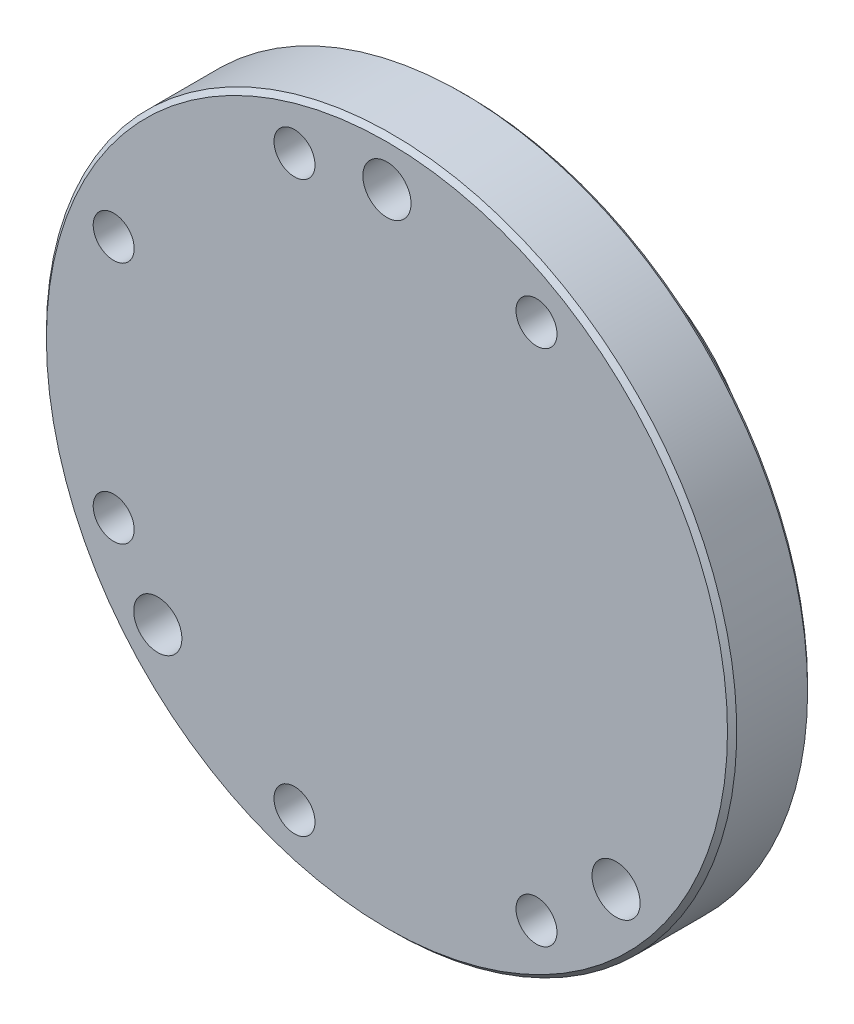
ISO-10303-21;
HEADER;
FILE_DESCRIPTION(('STEP AP214'),'2;1');
FILE_NAME('part.step','',(''),(''),'','','');
FILE_SCHEMA(('AUTOMOTIVE_DESIGN { 1 0 10303 214 1 1 1 1 }'));
ENDSEC;
DATA;
#1=APPLICATION_CONTEXT('core data for automotive mechanical design processes');
#2=APPLICATION_PROTOCOL_DEFINITION('international standard','automotive_design',2000,#1);
#3=PRODUCT_CONTEXT('',#1,'mechanical');
#4=PRODUCT('Part','Part','',(#3));
#5=PRODUCT_RELATED_PRODUCT_CATEGORY('part','',(#4));
#6=PRODUCT_DEFINITION_FORMATION('','',#4);
#7=PRODUCT_DEFINITION_CONTEXT('part definition',#1,'design');
#8=PRODUCT_DEFINITION('design','',#6,#7);
#9=PRODUCT_DEFINITION_SHAPE('','',#8);
#10=(LENGTH_UNIT() NAMED_UNIT(*) SI_UNIT(.MILLI.,.METRE.));
#11=(NAMED_UNIT(*) PLANE_ANGLE_UNIT() SI_UNIT($,.RADIAN.));
#12=(NAMED_UNIT(*) SI_UNIT($,.STERADIAN.) SOLID_ANGLE_UNIT());
#13=UNCERTAINTY_MEASURE_WITH_UNIT(LENGTH_MEASURE(1.E-05),#10,'distance_accuracy_value','');
#14=(GEOMETRIC_REPRESENTATION_CONTEXT(3) GLOBAL_UNCERTAINTY_ASSIGNED_CONTEXT((#13)) GLOBAL_UNIT_ASSIGNED_CONTEXT((#10,
#11,#12)) REPRESENTATION_CONTEXT('',''));
#15=CARTESIAN_POINT('',(0.,0.,0.));
#16=DIRECTION('',(0.,0.,1.));
#17=DIRECTION('',(1.,0.,0.));
#18=AXIS2_PLACEMENT_3D('',#15,#16,#17);
#19=CARTESIAN_POINT('',(0.,0.,13.208));
#20=DIRECTION('',(0.,0.,-1.));
#21=DIRECTION('',(-1.,0.,0.));
#22=AXIS2_PLACEMENT_3D('',#19,#20,#21);
#23=CYLINDRICAL_SURFACE('',#22,56.896);
#24=CARTESIAN_POINT('',(0.,0.,12.446));
#25=DIRECTION('',(0.,0.,1.));
#26=DIRECTION('',(1.,0.,0.));
#27=AXIS2_PLACEMENT_3D('',#24,#25,#26);
#28=CIRCLE('',#27,56.896);
#29=CARTESIAN_POINT('',(-56.896,0.,12.446));
#30=VERTEX_POINT('',#29);
#31=EDGE_CURVE('E385',#30,#30,#28,.F.);
#32=CARTESIAN_POINT('',(0.,0.,0.761999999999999));
#33=DIRECTION('',(0.,0.,1.));
#34=DIRECTION('',(1.,0.,0.));
#35=AXIS2_PLACEMENT_3D('',#32,#33,#34);
#36=CIRCLE('',#35,56.896);
#37=CARTESIAN_POINT('',(-56.896,0.,0.761999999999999));
#38=VERTEX_POINT('',#37);
#39=EDGE_CURVE('E390',#38,#38,#36,.T.);
#40=CARTESIAN_POINT('',(-56.896,0.,12.446));
#41=CARTESIAN_POINT('',(-56.896,0.,12.3242916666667));
#42=CARTESIAN_POINT('',(-56.896,0.,12.2025833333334));
#43=CARTESIAN_POINT('',(-56.896,0.,11.9591666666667));
#44=CARTESIAN_POINT('',(-56.896,0.,11.8374583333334));
#45=CARTESIAN_POINT('',(-56.896,0.,11.5940416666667));
#46=CARTESIAN_POINT('',(-56.896,0.,11.4723333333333));
#47=CARTESIAN_POINT('',(-56.896,0.,11.2289166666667));
#48=CARTESIAN_POINT('',(-56.896,0.,11.1072083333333));
#49=CARTESIAN_POINT('',(-56.896,0.,10.8637916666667));
#50=CARTESIAN_POINT('',(-56.896,0.,10.7420833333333));
#51=CARTESIAN_POINT('',(-56.896,0.,10.4986666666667));
#52=CARTESIAN_POINT('',(-56.896,0.,10.3769583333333));
#53=CARTESIAN_POINT('',(-56.896,0.,10.1335416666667));
#54=CARTESIAN_POINT('',(-56.896,0.,10.0118333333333));
#55=CARTESIAN_POINT('',(-56.896,0.,9.76841666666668));
#56=CARTESIAN_POINT('',(-56.896,0.,9.64670833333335));
#57=CARTESIAN_POINT('',(-56.896,0.,9.40329166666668));
#58=CARTESIAN_POINT('',(-56.896,0.,9.28158333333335));
#59=CARTESIAN_POINT('',(-56.896,0.,9.03816666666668));
#60=CARTESIAN_POINT('',(-56.896,0.,8.91645833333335));
#61=CARTESIAN_POINT('',(-56.896,0.,8.67304166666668));
#62=CARTESIAN_POINT('',(-56.896,0.,8.55133333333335));
#63=CARTESIAN_POINT('',(-56.896,0.,8.30791666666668));
#64=CARTESIAN_POINT('',(-56.896,0.,8.18620833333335));
#65=CARTESIAN_POINT('',(-56.896,0.,7.94279166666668));
#66=CARTESIAN_POINT('',(-56.896,0.,7.82108333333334));
#67=CARTESIAN_POINT('',(-56.896,0.,7.57766666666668));
#68=CARTESIAN_POINT('',(-56.896,0.,7.45595833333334));
#69=CARTESIAN_POINT('',(-56.896,0.,7.21254166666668));
#70=CARTESIAN_POINT('',(-56.896,0.,7.09083333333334));
#71=CARTESIAN_POINT('',(-56.896,0.,6.84741666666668));
#72=CARTESIAN_POINT('',(-56.896,0.,6.72570833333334));
#73=CARTESIAN_POINT('',(-56.896,0.,6.48229166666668));
#74=CARTESIAN_POINT('',(-56.896,0.,6.36058333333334));
#75=CARTESIAN_POINT('',(-56.896,0.,6.11716666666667));
#76=CARTESIAN_POINT('',(-56.896,0.,5.99545833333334));
#77=CARTESIAN_POINT('',(-56.896,0.,5.75204166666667));
#78=CARTESIAN_POINT('',(-56.896,0.,5.63033333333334));
#79=CARTESIAN_POINT('',(-56.896,0.,5.38691666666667));
#80=CARTESIAN_POINT('',(-56.896,0.,5.26520833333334));
#81=CARTESIAN_POINT('',(-56.896,0.,5.02179166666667));
#82=CARTESIAN_POINT('',(-56.896,0.,4.90008333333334));
#83=CARTESIAN_POINT('',(-56.896,0.,4.65666666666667));
#84=CARTESIAN_POINT('',(-56.896,0.,4.53495833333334));
#85=CARTESIAN_POINT('',(-56.896,0.,4.29154166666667));
#86=CARTESIAN_POINT('',(-56.896,0.,4.16983333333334));
#87=CARTESIAN_POINT('',(-56.896,0.,3.92641666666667));
#88=CARTESIAN_POINT('',(-56.896,0.,3.80470833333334));
#89=CARTESIAN_POINT('',(-56.896,0.,3.56129166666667));
#90=CARTESIAN_POINT('',(-56.896,0.,3.43958333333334));
#91=CARTESIAN_POINT('',(-56.896,0.,3.19616666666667));
#92=CARTESIAN_POINT('',(-56.896,0.,3.07445833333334));
#93=CARTESIAN_POINT('',(-56.896,0.,2.83104166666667));
#94=CARTESIAN_POINT('',(-56.896,0.,2.70933333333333));
#95=CARTESIAN_POINT('',(-56.896,0.,2.46591666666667));
#96=CARTESIAN_POINT('',(-56.896,0.,2.34420833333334));
#97=CARTESIAN_POINT('',(-56.896,0.,2.10079166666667));
#98=CARTESIAN_POINT('',(-56.896,0.,1.97908333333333));
#99=CARTESIAN_POINT('',(-56.896,0.,1.73566666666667));
#100=CARTESIAN_POINT('',(-56.896,0.,1.61395833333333));
#101=CARTESIAN_POINT('',(-56.896,0.,1.37054166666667));
#102=CARTESIAN_POINT('',(-56.896,0.,1.24883333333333));
#103=CARTESIAN_POINT('',(-56.896,0.,1.00541666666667));
#104=CARTESIAN_POINT('',(-56.896,0.,0.883708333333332));
#105=CARTESIAN_POINT('',(-56.896,0.,0.761999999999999));
#106=B_SPLINE_CURVE_WITH_KNOTS('',3,(#40,#41,#42,#43,#44,#45,#46,#47,#48,#49,#50,#51,#52,#53,
#54,#55,#56,#57,#58,#59,#60,#61,#62,#63,#64,#65,#66,#67,#68,#69,#70,#71,#72,#73,#74,#75,#76,#77,
#78,#79,#80,#81,#82,#83,#84,#85,#86,#87,#88,#89,#90,#91,#92,#93,#94,#95,#96,#97,#98,#99,#100,
#101,#102,#103,#104,#105),.UNSPECIFIED.,.F.,.F.,(4,2,2,2,2,2,2,2,2,2,2,2,2,2,2,2,2,2,2,2,2,2,2,
2,2,2,2,2,2,2,2,2,4),(0.,0.365124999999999,0.73025,1.095375,1.4605,1.825625,2.19075,2.555875,
2.921,3.286125,3.65125,4.016375,4.38150000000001,4.74662500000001,5.11175000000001,
5.47687500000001,5.84200000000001,6.20712500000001,6.57225000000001,6.93737500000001,
7.30250000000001,7.66762500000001,8.03275000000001,8.39787500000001,8.76300000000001,
9.12812500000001,9.49325000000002,9.85837500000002,10.2235,10.588625,10.95375,11.318875,11.684),.UNSPECIFIED.);
#107=EDGE_CURVE('BSEAM378',#30,#38,#106,.T.);
#108=ORIENTED_EDGE('',*,*,#31,.T.);
#109=ORIENTED_EDGE('',*,*,#39,.T.);
#110=ORIENTED_EDGE('',*,*,#107,.T.);
#111=ORIENTED_EDGE('',*,*,#107,.F.);
#112=EDGE_LOOP('',(#108,#110,#109,#111));
#113=FACE_BOUND('',#112,.T.);
#114=ADVANCED_FACE('F378',(#113),#23,.T.);
#115=CARTESIAN_POINT('',(0.,0.,13.208));
#116=DIRECTION('',(0.,0.,1.));
#117=DIRECTION('',(1.,0.,0.));
#118=AXIS2_PLACEMENT_3D('',#115,#116,#117);
#119=PLANE('',#118);
#120=CARTESIAN_POINT('',(-37.7670635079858,-31.6903290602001,13.208));
#121=DIRECTION('',(0.,0.,1.));
#122=DIRECTION('',(1.,0.,0.));
#123=AXIS2_PLACEMENT_3D('',#120,#121,#122);
#124=CIRCLE('',#123,3.96875);
#125=CARTESIAN_POINT('',(-33.7983135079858,-31.6903290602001,13.208));
#126=VERTEX_POINT('',#125);
#127=EDGE_CURVE('E808',#126,#126,#124,.T.);
#128=ORIENTED_EDGE('',*,*,#127,.F.);
#129=EDGE_LOOP('',(#128));
#130=FACE_BOUND('',#129,.T.);
#131=CARTESIAN_POINT('',(0.,49.3014,13.208));
#132=DIRECTION('',(0.,0.,1.));
#133=DIRECTION('',(1.,0.,0.));
#134=AXIS2_PLACEMENT_3D('',#131,#132,#133);
#135=CIRCLE('',#134,3.96875);
#136=CARTESIAN_POINT('',(3.96875,49.3014,13.208));
#137=VERTEX_POINT('',#136);
#138=EDGE_CURVE('E401',#137,#137,#135,.T.);
#139=ORIENTED_EDGE('',*,*,#138,.F.);
#140=EDGE_LOOP('',(#139));
#141=FACE_BOUND('',#140,.T.);
#142=CARTESIAN_POINT('',(37.7670635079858,-31.6903290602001,13.208));
#143=DIRECTION('',(0.,0.,1.));
#144=DIRECTION('',(1.,0.,0.));
#145=AXIS2_PLACEMENT_3D('',#142,#143,#144);
#146=CIRCLE('',#145,3.96875);
#147=CARTESIAN_POINT('',(41.7358135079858,-31.6903290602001,13.208));
#148=VERTEX_POINT('',#147);
#149=EDGE_CURVE('E397',#148,#148,#146,.T.);
#150=ORIENTED_EDGE('',*,*,#149,.F.);
#151=EDGE_LOOP('',(#150));
#152=FACE_BOUND('',#151,.T.);
#153=CARTESIAN_POINT('',(0.,0.,13.208));
#154=DIRECTION('',(0.,0.,1.));
#155=DIRECTION('',(1.,0.,0.));
#156=AXIS2_PLACEMENT_3D('',#153,#154,#155);
#157=CIRCLE('',#156,56.134);
#158=CARTESIAN_POINT('',(56.134,0.,13.208));
#159=VERTEX_POINT('',#158);
#160=EDGE_CURVE('E492',#159,#159,#157,.T.);
#161=ORIENTED_EDGE('',*,*,#160,.T.);
#162=EDGE_LOOP('',(#161));
#163=FACE_BOUND('',#162,.T.);
#164=CARTESIAN_POINT('',(24.6507000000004,-42.6962648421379,13.208));
#165=DIRECTION('',(0.,0.,1.));
#166=DIRECTION('',(1.,0.,0.));
#167=AXIS2_PLACEMENT_3D('',#164,#165,#166);
#168=CIRCLE('',#167,3.37819999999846);
#169=CARTESIAN_POINT('',(28.0288999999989,-42.6962648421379,13.208));
#170=VERTEX_POINT('',#169);
#171=EDGE_CURVE('E444',#170,#170,#168,.T.);
#172=ORIENTED_EDGE('',*,*,#171,.F.);
#173=EDGE_LOOP('',(#172));
#174=FACE_BOUND('',#173,.T.);
#175=CARTESIAN_POINT('',(-15.2349704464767,-46.888417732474,13.208));
#176=DIRECTION('',(0.,0.,1.));
#177=DIRECTION('',(1.,0.,0.));
#178=AXIS2_PLACEMENT_3D('',#175,#176,#177);
#179=CIRCLE('',#178,3.3782);
#180=CARTESIAN_POINT('',(-11.8567704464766,-46.888417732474,13.208));
#181=VERTEX_POINT('',#180);
#182=EDGE_CURVE('E450',#181,#181,#179,.T.);
#183=ORIENTED_EDGE('',*,*,#182,.F.);
#184=EDGE_LOOP('',(#183));
#185=FACE_BOUND('',#184,.T.);
#186=CARTESIAN_POINT('',(-45.0390700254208,-20.0526859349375,13.208));
#187=DIRECTION('',(0.,0.,1.));
#188=DIRECTION('',(1.,0.,0.));
#189=AXIS2_PLACEMENT_3D('',#186,#187,#188);
#190=CIRCLE('',#189,3.37820000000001);
#191=CARTESIAN_POINT('',(-41.6608700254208,-20.0526859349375,13.208));
#192=VERTEX_POINT('',#191);
#193=EDGE_CURVE('E456',#192,#192,#190,.T.);
#194=ORIENTED_EDGE('',*,*,#193,.F.);
#195=EDGE_LOOP('',(#194));
#196=FACE_BOUND('',#195,.T.);
#197=CARTESIAN_POINT('',(-45.039070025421,20.0526859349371,13.208));
#198=DIRECTION('',(0.,0.,1.));
#199=DIRECTION('',(1.,0.,0.));
#200=AXIS2_PLACEMENT_3D('',#197,#198,#199);
#201=CIRCLE('',#200,3.3782);
#202=CARTESIAN_POINT('',(-41.660870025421,20.0526859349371,13.208));
#203=VERTEX_POINT('',#202);
#204=EDGE_CURVE('E462',#203,#203,#201,.T.);
#205=ORIENTED_EDGE('',*,*,#204,.F.);
#206=EDGE_LOOP('',(#205));
#207=FACE_BOUND('',#206,.T.);
#208=CARTESIAN_POINT('',(-15.2349704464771,46.8884177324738,13.208));
#209=DIRECTION('',(0.,0.,1.));
#210=DIRECTION('',(1.,0.,0.));
#211=AXIS2_PLACEMENT_3D('',#208,#209,#210);
#212=CIRCLE('',#211,3.3782);
#213=CARTESIAN_POINT('',(-11.8567704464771,46.8884177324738,13.208));
#214=VERTEX_POINT('',#213);
#215=EDGE_CURVE('E468',#214,#214,#212,.T.);
#216=ORIENTED_EDGE('',*,*,#215,.F.);
#217=EDGE_LOOP('',(#216));
#218=FACE_BOUND('',#217,.T.);
#219=CARTESIAN_POINT('',(24.6507000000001,42.6962648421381,13.208));
#220=DIRECTION('',(0.,0.,1.));
#221=DIRECTION('',(1.,0.,0.));
#222=AXIS2_PLACEMENT_3D('',#219,#220,#221);
#223=CIRCLE('',#222,3.3782);
#224=CARTESIAN_POINT('',(28.0289000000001,42.6962648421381,13.208));
#225=VERTEX_POINT('',#224);
#226=EDGE_CURVE('E474',#225,#225,#223,.T.);
#227=ORIENTED_EDGE('',*,*,#226,.F.);
#228=EDGE_LOOP('',(#227));
#229=FACE_BOUND('',#228,.T.);
#230=ADVANCED_FACE('F517',(#130,#141,#152,#163,#174,#185,#196,#207,#218,#229),#119,.T.);
#231=CARTESIAN_POINT('',(0.,0.,0.));
#232=DIRECTION('',(0.,0.,1.));
#233=DIRECTION('',(1.,0.,0.));
#234=AXIS2_PLACEMENT_3D('',#231,#232,#233);
#235=PLANE('',#234);
#236=CARTESIAN_POINT('',(-37.7670635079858,-31.6903290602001,0.));
#237=DIRECTION('',(0.,0.,1.));
#238=DIRECTION('',(1.,0.,0.));
#239=AXIS2_PLACEMENT_3D('',#236,#237,#238);
#240=CIRCLE('',#239,2.7686);
#241=CARTESIAN_POINT('',(-34.9984635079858,-31.6903290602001,0.));
#242=VERTEX_POINT('',#241);
#243=EDGE_CURVE('E381',#242,#242,#240,.T.);
#244=ORIENTED_EDGE('',*,*,#243,.T.);
#245=EDGE_LOOP('',(#244));
#246=FACE_BOUND('',#245,.T.);
#247=CARTESIAN_POINT('',(0.,49.3014,0.));
#248=DIRECTION('',(0.,0.,1.));
#249=DIRECTION('',(1.,0.,0.));
#250=AXIS2_PLACEMENT_3D('',#247,#248,#249);
#251=CIRCLE('',#250,2.7686);
#252=CARTESIAN_POINT('',(2.7686,49.3014,0.));
#253=VERTEX_POINT('',#252);
#254=EDGE_CURVE('E398',#253,#253,#251,.T.);
#255=ORIENTED_EDGE('',*,*,#254,.T.);
#256=EDGE_LOOP('',(#255));
#257=FACE_BOUND('',#256,.T.);
#258=CARTESIAN_POINT('',(37.7670635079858,-31.6903290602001,0.));
#259=DIRECTION('',(0.,0.,1.));
#260=DIRECTION('',(1.,0.,0.));
#261=AXIS2_PLACEMENT_3D('',#258,#259,#260);
#262=CIRCLE('',#261,2.7686);
#263=CARTESIAN_POINT('',(40.5356635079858,-31.6903290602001,0.));
#264=VERTEX_POINT('',#263);
#265=EDGE_CURVE('E394',#264,#264,#262,.T.);
#266=ORIENTED_EDGE('',*,*,#265,.T.);
#267=EDGE_LOOP('',(#266));
#268=FACE_BOUND('',#267,.T.);
#269=CARTESIAN_POINT('',(0.,0.,0.));
#270=DIRECTION('',(0.,0.,1.));
#271=DIRECTION('',(1.,0.,0.));
#272=AXIS2_PLACEMENT_3D('',#269,#270,#271);
#273=CIRCLE('',#272,56.134);
#274=CARTESIAN_POINT('',(56.134,0.,0.));
#275=VERTEX_POINT('',#274);
#276=EDGE_CURVE('E10',#275,#275,#273,.F.);
#277=ORIENTED_EDGE('',*,*,#276,.T.);
#278=EDGE_LOOP('',(#277));
#279=FACE_BOUND('',#278,.T.);
#280=CARTESIAN_POINT('',(0.,0.,0.));
#281=DIRECTION('',(0.,0.,1.));
#282=DIRECTION('',(1.,0.,0.));
#283=AXIS2_PLACEMENT_3D('',#280,#281,#282);
#284=CIRCLE('',#283,32.2326);
#285=CARTESIAN_POINT('',(32.2326,0.,0.));
#286=VERTEX_POINT('',#285);
#287=EDGE_CURVE('E489',#286,#286,#284,.T.);
#288=ORIENTED_EDGE('',*,*,#287,.T.);
#289=EDGE_LOOP('',(#288));
#290=FACE_BOUND('',#289,.T.);
#291=CARTESIAN_POINT('',(24.6507000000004,-42.6962648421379,0.));
#292=DIRECTION('',(0.,0.,1.));
#293=DIRECTION('',(1.,0.,0.));
#294=AXIS2_PLACEMENT_3D('',#291,#292,#293);
#295=CIRCLE('',#294,3.37819999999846);
#296=CARTESIAN_POINT('',(28.0288999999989,-42.6962648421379,0.));
#297=VERTEX_POINT('',#296);
#298=EDGE_CURVE('E447',#297,#297,#295,.T.);
#299=ORIENTED_EDGE('',*,*,#298,.T.);
#300=EDGE_LOOP('',(#299));
#301=FACE_BOUND('',#300,.T.);
#302=CARTESIAN_POINT('',(-15.2349704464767,-46.888417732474,0.));
#303=DIRECTION('',(0.,0.,1.));
#304=DIRECTION('',(1.,0.,0.));
#305=AXIS2_PLACEMENT_3D('',#302,#303,#304);
#306=CIRCLE('',#305,3.3782);
#307=CARTESIAN_POINT('',(-11.8567704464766,-46.888417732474,0.));
#308=VERTEX_POINT('',#307);
#309=EDGE_CURVE('E453',#308,#308,#306,.T.);
#310=ORIENTED_EDGE('',*,*,#309,.T.);
#311=EDGE_LOOP('',(#310));
#312=FACE_BOUND('',#311,.T.);
#313=CARTESIAN_POINT('',(-45.0390700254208,-20.0526859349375,0.));
#314=DIRECTION('',(0.,0.,1.));
#315=DIRECTION('',(1.,0.,0.));
#316=AXIS2_PLACEMENT_3D('',#313,#314,#315);
#317=CIRCLE('',#316,3.37820000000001);
#318=CARTESIAN_POINT('',(-41.6608700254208,-20.0526859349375,0.));
#319=VERTEX_POINT('',#318);
#320=EDGE_CURVE('E459',#319,#319,#317,.T.);
#321=ORIENTED_EDGE('',*,*,#320,.T.);
#322=EDGE_LOOP('',(#321));
#323=FACE_BOUND('',#322,.T.);
#324=CARTESIAN_POINT('',(-45.039070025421,20.0526859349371,0.));
#325=DIRECTION('',(0.,0.,1.));
#326=DIRECTION('',(1.,0.,0.));
#327=AXIS2_PLACEMENT_3D('',#324,#325,#326);
#328=CIRCLE('',#327,3.3782);
#329=CARTESIAN_POINT('',(-41.660870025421,20.0526859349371,0.));
#330=VERTEX_POINT('',#329);
#331=EDGE_CURVE('E465',#330,#330,#328,.T.);
#332=ORIENTED_EDGE('',*,*,#331,.T.);
#333=EDGE_LOOP('',(#332));
#334=FACE_BOUND('',#333,.T.);
#335=CARTESIAN_POINT('',(-15.2349704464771,46.8884177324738,0.));
#336=DIRECTION('',(0.,0.,1.));
#337=DIRECTION('',(1.,0.,0.));
#338=AXIS2_PLACEMENT_3D('',#335,#336,#337);
#339=CIRCLE('',#338,3.3782);
#340=CARTESIAN_POINT('',(-11.8567704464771,46.8884177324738,0.));
#341=VERTEX_POINT('',#340);
#342=EDGE_CURVE('E471',#341,#341,#339,.T.);
#343=ORIENTED_EDGE('',*,*,#342,.T.);
#344=EDGE_LOOP('',(#343));
#345=FACE_BOUND('',#344,.T.);
#346=CARTESIAN_POINT('',(24.6507000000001,42.6962648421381,0.));
#347=DIRECTION('',(0.,0.,1.));
#348=DIRECTION('',(1.,0.,0.));
#349=AXIS2_PLACEMENT_3D('',#346,#347,#348);
#350=CIRCLE('',#349,3.3782);
#351=CARTESIAN_POINT('',(28.0289000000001,42.6962648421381,0.));
#352=VERTEX_POINT('',#351);
#353=EDGE_CURVE('E477',#352,#352,#350,.T.);
#354=ORIENTED_EDGE('',*,*,#353,.T.);
#355=EDGE_LOOP('',(#354));
#356=FACE_BOUND('',#355,.T.);
#357=ADVANCED_FACE('F522',(#246,#257,#268,#279,#290,#301,#312,#323,#334,#345,#356),#235,.F.);
#358=CARTESIAN_POINT('',(24.6507000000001,42.6962648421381,0.));
#359=DIRECTION('',(0.,0.,1.));
#360=DIRECTION('',(1.,0.,0.));
#361=AXIS2_PLACEMENT_3D('',#358,#359,#360);
#362=CYLINDRICAL_SURFACE('',#361,3.3782);
#363=CARTESIAN_POINT('',(28.0289000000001,42.6962648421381,0.));
#364=CARTESIAN_POINT('',(28.0289000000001,42.6962648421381,0.137583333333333));
#365=CARTESIAN_POINT('',(28.0289000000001,42.6962648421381,0.275166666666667));
#366=CARTESIAN_POINT('',(28.0289000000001,42.6962648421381,0.550333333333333));
#367=CARTESIAN_POINT('',(28.0289000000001,42.6962648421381,0.687916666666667));
#368=CARTESIAN_POINT('',(28.0289000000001,42.6962648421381,0.963083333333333));
#369=CARTESIAN_POINT('',(28.0289000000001,42.6962648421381,1.10066666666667));
#370=CARTESIAN_POINT('',(28.0289000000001,42.6962648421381,1.37583333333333));
#371=CARTESIAN_POINT('',(28.0289000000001,42.6962648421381,1.51341666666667));
#372=CARTESIAN_POINT('',(28.0289000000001,42.6962648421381,1.78858333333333));
#373=CARTESIAN_POINT('',(28.0289000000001,42.6962648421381,1.92616666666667));
#374=CARTESIAN_POINT('',(28.0289000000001,42.6962648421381,2.20133333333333));
#375=CARTESIAN_POINT('',(28.0289000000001,42.6962648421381,2.33891666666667));
#376=CARTESIAN_POINT('',(28.0289000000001,42.6962648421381,2.61408333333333));
#377=CARTESIAN_POINT('',(28.0289000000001,42.6962648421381,2.75166666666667));
#378=CARTESIAN_POINT('',(28.0289000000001,42.6962648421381,3.02683333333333));
#379=CARTESIAN_POINT('',(28.0289000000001,42.6962648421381,3.16441666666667));
#380=CARTESIAN_POINT('',(28.0289000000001,42.6962648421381,3.43958333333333));
#381=CARTESIAN_POINT('',(28.0289000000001,42.6962648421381,3.57716666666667));
#382=CARTESIAN_POINT('',(28.0289000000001,42.6962648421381,3.85233333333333));
#383=CARTESIAN_POINT('',(28.0289000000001,42.6962648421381,3.98991666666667));
#384=CARTESIAN_POINT('',(28.0289000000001,42.6962648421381,4.26508333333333));
#385=CARTESIAN_POINT('',(28.0289000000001,42.6962648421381,4.40266666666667));
#386=CARTESIAN_POINT('',(28.0289000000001,42.6962648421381,4.67783333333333));
#387=CARTESIAN_POINT('',(28.0289000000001,42.6962648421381,4.81541666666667));
#388=CARTESIAN_POINT('',(28.0289000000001,42.6962648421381,5.09058333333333));
#389=CARTESIAN_POINT('',(28.0289000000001,42.6962648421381,5.22816666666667));
#390=CARTESIAN_POINT('',(28.0289000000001,42.6962648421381,5.50333333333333));
#391=CARTESIAN_POINT('',(28.0289000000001,42.6962648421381,5.64091666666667));
#392=CARTESIAN_POINT('',(28.0289000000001,42.6962648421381,5.91608333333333));
#393=CARTESIAN_POINT('',(28.0289000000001,42.6962648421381,6.05366666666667));
#394=CARTESIAN_POINT('',(28.0289000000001,42.6962648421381,6.32883333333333));
#395=CARTESIAN_POINT('',(28.0289000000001,42.6962648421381,6.46641666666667));
#396=CARTESIAN_POINT('',(28.0289000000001,42.6962648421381,6.74158333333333));
#397=CARTESIAN_POINT('',(28.0289000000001,42.6962648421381,6.87916666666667));
#398=CARTESIAN_POINT('',(28.0289000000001,42.6962648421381,7.15433333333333));
#399=CARTESIAN_POINT('',(28.0289000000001,42.6962648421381,7.29191666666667));
#400=CARTESIAN_POINT('',(28.0289000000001,42.6962648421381,7.56708333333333));
#401=CARTESIAN_POINT('',(28.0289000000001,42.6962648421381,7.70466666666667));
#402=CARTESIAN_POINT('',(28.0289000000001,42.6962648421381,7.97983333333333));
#403=CARTESIAN_POINT('',(28.0289000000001,42.6962648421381,8.11741666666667));
#404=CARTESIAN_POINT('',(28.0289000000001,42.6962648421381,8.39258333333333));
#405=CARTESIAN_POINT('',(28.0289000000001,42.6962648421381,8.53016666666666));
#406=CARTESIAN_POINT('',(28.0289000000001,42.6962648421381,8.80533333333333));
#407=CARTESIAN_POINT('',(28.0289000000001,42.6962648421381,8.94291666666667));
#408=CARTESIAN_POINT('',(28.0289000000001,42.6962648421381,9.21808333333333));
#409=CARTESIAN_POINT('',(28.0289000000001,42.6962648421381,9.35566666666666));
#410=CARTESIAN_POINT('',(28.0289000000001,42.6962648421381,9.63083333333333));
#411=CARTESIAN_POINT('',(28.0289000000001,42.6962648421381,9.76841666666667));
#412=CARTESIAN_POINT('',(28.0289000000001,42.6962648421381,10.0435833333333));
#413=CARTESIAN_POINT('',(28.0289000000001,42.6962648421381,10.1811666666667));
#414=CARTESIAN_POINT('',(28.0289000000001,42.6962648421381,10.4563333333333));
#415=CARTESIAN_POINT('',(28.0289000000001,42.6962648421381,10.5939166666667));
#416=CARTESIAN_POINT('',(28.0289000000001,42.6962648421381,10.8690833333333));
#417=CARTESIAN_POINT('',(28.0289000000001,42.6962648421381,11.0066666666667));
#418=CARTESIAN_POINT('',(28.0289000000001,42.6962648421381,11.2818333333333));
#419=CARTESIAN_POINT('',(28.0289000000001,42.6962648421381,11.4194166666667));
#420=CARTESIAN_POINT('',(28.0289000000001,42.6962648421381,11.6945833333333));
#421=CARTESIAN_POINT('',(28.0289000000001,42.6962648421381,11.8321666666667));
#422=CARTESIAN_POINT('',(28.0289000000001,42.6962648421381,12.1073333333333));
#423=CARTESIAN_POINT('',(28.0289000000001,42.6962648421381,12.2449166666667));
#424=CARTESIAN_POINT('',(28.0289000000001,42.6962648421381,12.5200833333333));
#425=CARTESIAN_POINT('',(28.0289000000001,42.6962648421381,12.6576666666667));
#426=CARTESIAN_POINT('',(28.0289000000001,42.6962648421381,12.9328333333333));
#427=CARTESIAN_POINT('',(28.0289000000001,42.6962648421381,13.0704166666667));
#428=CARTESIAN_POINT('',(28.0289000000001,42.6962648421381,13.208));
#429=B_SPLINE_CURVE_WITH_KNOTS('',3,(#363,#364,#365,#366,#367,#368,#369,#370,#371,#372,#373,
#374,#375,#376,#377,#378,#379,#380,#381,#382,#383,#384,#385,#386,#387,#388,#389,#390,#391,#392,
#393,#394,#395,#396,#397,#398,#399,#400,#401,#402,#403,#404,#405,#406,#407,#408,#409,#410,#411,
#412,#413,#414,#415,#416,#417,#418,#419,#420,#421,#422,#423,#424,#425,#426,#427,#428),
.UNSPECIFIED.,.F.,.F.,(4,2,2,2,2,2,2,2,2,2,2,2,2,2,2,2,2,2,2,2,2,2,2,2,2,2,2,2,2,2,2,2,4),(0.,
0.41275,0.8255,1.23825,1.651,2.06375,2.4765,2.88925,3.302,3.71475,4.1275,4.54025,4.953,5.36575,
5.7785,6.19125,6.604,7.01675,7.4295,7.84225,8.255,8.66775,9.0805,9.49325,9.906,10.31875,10.7315,
11.14425,11.557,11.96975,12.3825,12.79525,13.208),.UNSPECIFIED.);
#430=EDGE_CURVE('BSEAM541',#352,#225,#429,.T.);
#431=ORIENTED_EDGE('',*,*,#353,.F.);
#432=ORIENTED_EDGE('',*,*,#226,.T.);
#433=ORIENTED_EDGE('',*,*,#430,.T.);
#434=ORIENTED_EDGE('',*,*,#430,.F.);
#435=EDGE_LOOP('',(#431,#433,#432,#434));
#436=FACE_BOUND('',#435,.T.);
#437=ADVANCED_FACE('F541',(#436),#362,.F.);
#438=CARTESIAN_POINT('',(-15.2349704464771,46.8884177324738,0.));
#439=DIRECTION('',(0.,0.,1.));
#440=DIRECTION('',(1.,0.,0.));
#441=AXIS2_PLACEMENT_3D('',#438,#439,#440);
#442=CYLINDRICAL_SURFACE('',#441,3.3782);
#443=CARTESIAN_POINT('',(-11.8567704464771,46.8884177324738,0.));
#444=CARTESIAN_POINT('',(-11.8567704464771,46.8884177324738,0.137583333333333));
#445=CARTESIAN_POINT('',(-11.8567704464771,46.8884177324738,0.275166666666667));
#446=CARTESIAN_POINT('',(-11.8567704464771,46.8884177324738,0.550333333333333));
#447=CARTESIAN_POINT('',(-11.8567704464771,46.8884177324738,0.687916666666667));
#448=CARTESIAN_POINT('',(-11.8567704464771,46.8884177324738,0.963083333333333));
#449=CARTESIAN_POINT('',(-11.8567704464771,46.8884177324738,1.10066666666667));
#450=CARTESIAN_POINT('',(-11.8567704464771,46.8884177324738,1.37583333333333));
#451=CARTESIAN_POINT('',(-11.8567704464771,46.8884177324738,1.51341666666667));
#452=CARTESIAN_POINT('',(-11.8567704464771,46.8884177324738,1.78858333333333));
#453=CARTESIAN_POINT('',(-11.8567704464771,46.8884177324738,1.92616666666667));
#454=CARTESIAN_POINT('',(-11.8567704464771,46.8884177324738,2.20133333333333));
#455=CARTESIAN_POINT('',(-11.8567704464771,46.8884177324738,2.33891666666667));
#456=CARTESIAN_POINT('',(-11.8567704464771,46.8884177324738,2.61408333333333));
#457=CARTESIAN_POINT('',(-11.8567704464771,46.8884177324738,2.75166666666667));
#458=CARTESIAN_POINT('',(-11.8567704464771,46.8884177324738,3.02683333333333));
#459=CARTESIAN_POINT('',(-11.8567704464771,46.8884177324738,3.16441666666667));
#460=CARTESIAN_POINT('',(-11.8567704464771,46.8884177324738,3.43958333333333));
#461=CARTESIAN_POINT('',(-11.8567704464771,46.8884177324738,3.57716666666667));
#462=CARTESIAN_POINT('',(-11.8567704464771,46.8884177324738,3.85233333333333));
#463=CARTESIAN_POINT('',(-11.8567704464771,46.8884177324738,3.98991666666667));
#464=CARTESIAN_POINT('',(-11.8567704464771,46.8884177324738,4.26508333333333));
#465=CARTESIAN_POINT('',(-11.8567704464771,46.8884177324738,4.40266666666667));
#466=CARTESIAN_POINT('',(-11.8567704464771,46.8884177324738,4.67783333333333));
#467=CARTESIAN_POINT('',(-11.8567704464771,46.8884177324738,4.81541666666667));
#468=CARTESIAN_POINT('',(-11.8567704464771,46.8884177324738,5.09058333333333));
#469=CARTESIAN_POINT('',(-11.8567704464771,46.8884177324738,5.22816666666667));
#470=CARTESIAN_POINT('',(-11.8567704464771,46.8884177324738,5.50333333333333));
#471=CARTESIAN_POINT('',(-11.8567704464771,46.8884177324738,5.64091666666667));
#472=CARTESIAN_POINT('',(-11.8567704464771,46.8884177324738,5.91608333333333));
#473=CARTESIAN_POINT('',(-11.8567704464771,46.8884177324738,6.05366666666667));
#474=CARTESIAN_POINT('',(-11.8567704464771,46.8884177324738,6.32883333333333));
#475=CARTESIAN_POINT('',(-11.8567704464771,46.8884177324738,6.46641666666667));
#476=CARTESIAN_POINT('',(-11.8567704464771,46.8884177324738,6.74158333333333));
#477=CARTESIAN_POINT('',(-11.8567704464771,46.8884177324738,6.87916666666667));
#478=CARTESIAN_POINT('',(-11.8567704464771,46.8884177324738,7.15433333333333));
#479=CARTESIAN_POINT('',(-11.8567704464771,46.8884177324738,7.29191666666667));
#480=CARTESIAN_POINT('',(-11.8567704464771,46.8884177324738,7.56708333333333));
#481=CARTESIAN_POINT('',(-11.8567704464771,46.8884177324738,7.70466666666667));
#482=CARTESIAN_POINT('',(-11.8567704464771,46.8884177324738,7.97983333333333));
#483=CARTESIAN_POINT('',(-11.8567704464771,46.8884177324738,8.11741666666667));
#484=CARTESIAN_POINT('',(-11.8567704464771,46.8884177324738,8.39258333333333));
#485=CARTESIAN_POINT('',(-11.8567704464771,46.8884177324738,8.53016666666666));
#486=CARTESIAN_POINT('',(-11.8567704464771,46.8884177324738,8.80533333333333));
#487=CARTESIAN_POINT('',(-11.8567704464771,46.8884177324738,8.94291666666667));
#488=CARTESIAN_POINT('',(-11.8567704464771,46.8884177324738,9.21808333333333));
#489=CARTESIAN_POINT('',(-11.8567704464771,46.8884177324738,9.35566666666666));
#490=CARTESIAN_POINT('',(-11.8567704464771,46.8884177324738,9.63083333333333));
#491=CARTESIAN_POINT('',(-11.8567704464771,46.8884177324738,9.76841666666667));
#492=CARTESIAN_POINT('',(-11.8567704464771,46.8884177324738,10.0435833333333));
#493=CARTESIAN_POINT('',(-11.8567704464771,46.8884177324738,10.1811666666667));
#494=CARTESIAN_POINT('',(-11.8567704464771,46.8884177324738,10.4563333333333));
#495=CARTESIAN_POINT('',(-11.8567704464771,46.8884177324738,10.5939166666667));
#496=CARTESIAN_POINT('',(-11.8567704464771,46.8884177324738,10.8690833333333));
#497=CARTESIAN_POINT('',(-11.8567704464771,46.8884177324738,11.0066666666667));
#498=CARTESIAN_POINT('',(-11.8567704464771,46.8884177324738,11.2818333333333));
#499=CARTESIAN_POINT('',(-11.8567704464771,46.8884177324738,11.4194166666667));
#500=CARTESIAN_POINT('',(-11.8567704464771,46.8884177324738,11.6945833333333));
#501=CARTESIAN_POINT('',(-11.8567704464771,46.8884177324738,11.8321666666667));
#502=CARTESIAN_POINT('',(-11.8567704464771,46.8884177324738,12.1073333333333));
#503=CARTESIAN_POINT('',(-11.8567704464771,46.8884177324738,12.2449166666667));
#504=CARTESIAN_POINT('',(-11.8567704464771,46.8884177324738,12.5200833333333));
#505=CARTESIAN_POINT('',(-11.8567704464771,46.8884177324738,12.6576666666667));
#506=CARTESIAN_POINT('',(-11.8567704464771,46.8884177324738,12.9328333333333));
#507=CARTESIAN_POINT('',(-11.8567704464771,46.8884177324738,13.0704166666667));
#508=CARTESIAN_POINT('',(-11.8567704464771,46.8884177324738,13.208));
#509=B_SPLINE_CURVE_WITH_KNOTS('',3,(#443,#444,#445,#446,#447,#448,#449,#450,#451,#452,#453,
#454,#455,#456,#457,#458,#459,#460,#461,#462,#463,#464,#465,#466,#467,#468,#469,#470,#471,#472,
#473,#474,#475,#476,#477,#478,#479,#480,#481,#482,#483,#484,#485,#486,#487,#488,#489,#490,#491,
#492,#493,#494,#495,#496,#497,#498,#499,#500,#501,#502,#503,#504,#505,#506,#507,#508),
.UNSPECIFIED.,.F.,.F.,(4,2,2,2,2,2,2,2,2,2,2,2,2,2,2,2,2,2,2,2,2,2,2,2,2,2,2,2,2,2,2,2,4),(0.,
0.41275,0.8255,1.23825,1.651,2.06375,2.4765,2.88925,3.302,3.71475,4.1275,4.54025,4.953,5.36575,
5.7785,6.19125,6.604,7.01675,7.4295,7.84225,8.255,8.66775,9.0805,9.49325,9.906,10.31875,10.7315,
11.14425,11.557,11.96975,12.3825,12.79525,13.208),.UNSPECIFIED.);
#510=EDGE_CURVE('BSEAM543',#341,#214,#509,.T.);
#511=ORIENTED_EDGE('',*,*,#342,.F.);
#512=ORIENTED_EDGE('',*,*,#215,.T.);
#513=ORIENTED_EDGE('',*,*,#510,.T.);
#514=ORIENTED_EDGE('',*,*,#510,.F.);
#515=EDGE_LOOP('',(#511,#513,#512,#514));
#516=FACE_BOUND('',#515,.T.);
#517=ADVANCED_FACE('F543',(#516),#442,.F.);
#518=CARTESIAN_POINT('',(-45.039070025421,20.0526859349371,0.));
#519=DIRECTION('',(0.,0.,1.));
#520=DIRECTION('',(1.,0.,0.));
#521=AXIS2_PLACEMENT_3D('',#518,#519,#520);
#522=CYLINDRICAL_SURFACE('',#521,3.3782);
#523=CARTESIAN_POINT('',(-41.660870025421,20.0526859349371,0.));
#524=CARTESIAN_POINT('',(-41.660870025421,20.0526859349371,0.137583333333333));
#525=CARTESIAN_POINT('',(-41.660870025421,20.0526859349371,0.275166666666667));
#526=CARTESIAN_POINT('',(-41.660870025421,20.0526859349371,0.550333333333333));
#527=CARTESIAN_POINT('',(-41.660870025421,20.0526859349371,0.687916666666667));
#528=CARTESIAN_POINT('',(-41.660870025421,20.0526859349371,0.963083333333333));
#529=CARTESIAN_POINT('',(-41.660870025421,20.0526859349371,1.10066666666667));
#530=CARTESIAN_POINT('',(-41.660870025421,20.0526859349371,1.37583333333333));
#531=CARTESIAN_POINT('',(-41.660870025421,20.0526859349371,1.51341666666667));
#532=CARTESIAN_POINT('',(-41.660870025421,20.0526859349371,1.78858333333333));
#533=CARTESIAN_POINT('',(-41.660870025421,20.0526859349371,1.92616666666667));
#534=CARTESIAN_POINT('',(-41.660870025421,20.0526859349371,2.20133333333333));
#535=CARTESIAN_POINT('',(-41.660870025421,20.0526859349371,2.33891666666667));
#536=CARTESIAN_POINT('',(-41.660870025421,20.0526859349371,2.61408333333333));
#537=CARTESIAN_POINT('',(-41.660870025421,20.0526859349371,2.75166666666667));
#538=CARTESIAN_POINT('',(-41.660870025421,20.0526859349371,3.02683333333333));
#539=CARTESIAN_POINT('',(-41.660870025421,20.0526859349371,3.16441666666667));
#540=CARTESIAN_POINT('',(-41.660870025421,20.0526859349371,3.43958333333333));
#541=CARTESIAN_POINT('',(-41.660870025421,20.0526859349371,3.57716666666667));
#542=CARTESIAN_POINT('',(-41.660870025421,20.0526859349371,3.85233333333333));
#543=CARTESIAN_POINT('',(-41.660870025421,20.0526859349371,3.98991666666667));
#544=CARTESIAN_POINT('',(-41.660870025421,20.0526859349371,4.26508333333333));
#545=CARTESIAN_POINT('',(-41.660870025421,20.0526859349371,4.40266666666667));
#546=CARTESIAN_POINT('',(-41.660870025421,20.0526859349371,4.67783333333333));
#547=CARTESIAN_POINT('',(-41.660870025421,20.0526859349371,4.81541666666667));
#548=CARTESIAN_POINT('',(-41.660870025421,20.0526859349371,5.09058333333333));
#549=CARTESIAN_POINT('',(-41.660870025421,20.0526859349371,5.22816666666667));
#550=CARTESIAN_POINT('',(-41.660870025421,20.0526859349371,5.50333333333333));
#551=CARTESIAN_POINT('',(-41.660870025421,20.0526859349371,5.64091666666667));
#552=CARTESIAN_POINT('',(-41.660870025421,20.0526859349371,5.91608333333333));
#553=CARTESIAN_POINT('',(-41.660870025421,20.0526859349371,6.05366666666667));
#554=CARTESIAN_POINT('',(-41.660870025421,20.0526859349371,6.32883333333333));
#555=CARTESIAN_POINT('',(-41.660870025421,20.0526859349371,6.46641666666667));
#556=CARTESIAN_POINT('',(-41.660870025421,20.0526859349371,6.74158333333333));
#557=CARTESIAN_POINT('',(-41.660870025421,20.0526859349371,6.87916666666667));
#558=CARTESIAN_POINT('',(-41.660870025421,20.0526859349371,7.15433333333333));
#559=CARTESIAN_POINT('',(-41.660870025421,20.0526859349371,7.29191666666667));
#560=CARTESIAN_POINT('',(-41.660870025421,20.0526859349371,7.56708333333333));
#561=CARTESIAN_POINT('',(-41.660870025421,20.0526859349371,7.70466666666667));
#562=CARTESIAN_POINT('',(-41.660870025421,20.0526859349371,7.97983333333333));
#563=CARTESIAN_POINT('',(-41.660870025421,20.0526859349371,8.11741666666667));
#564=CARTESIAN_POINT('',(-41.660870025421,20.0526859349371,8.39258333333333));
#565=CARTESIAN_POINT('',(-41.660870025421,20.0526859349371,8.53016666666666));
#566=CARTESIAN_POINT('',(-41.660870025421,20.0526859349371,8.80533333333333));
#567=CARTESIAN_POINT('',(-41.660870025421,20.0526859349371,8.94291666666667));
#568=CARTESIAN_POINT('',(-41.660870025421,20.0526859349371,9.21808333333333));
#569=CARTESIAN_POINT('',(-41.660870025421,20.0526859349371,9.35566666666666));
#570=CARTESIAN_POINT('',(-41.660870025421,20.0526859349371,9.63083333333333));
#571=CARTESIAN_POINT('',(-41.660870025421,20.0526859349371,9.76841666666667));
#572=CARTESIAN_POINT('',(-41.660870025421,20.0526859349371,10.0435833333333));
#573=CARTESIAN_POINT('',(-41.660870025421,20.0526859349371,10.1811666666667));
#574=CARTESIAN_POINT('',(-41.660870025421,20.0526859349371,10.4563333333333));
#575=CARTESIAN_POINT('',(-41.660870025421,20.0526859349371,10.5939166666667));
#576=CARTESIAN_POINT('',(-41.660870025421,20.0526859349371,10.8690833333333));
#577=CARTESIAN_POINT('',(-41.660870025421,20.0526859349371,11.0066666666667));
#578=CARTESIAN_POINT('',(-41.660870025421,20.0526859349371,11.2818333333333));
#579=CARTESIAN_POINT('',(-41.660870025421,20.0526859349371,11.4194166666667));
#580=CARTESIAN_POINT('',(-41.660870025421,20.0526859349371,11.6945833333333));
#581=CARTESIAN_POINT('',(-41.660870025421,20.0526859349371,11.8321666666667));
#582=CARTESIAN_POINT('',(-41.660870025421,20.0526859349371,12.1073333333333));
#583=CARTESIAN_POINT('',(-41.660870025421,20.0526859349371,12.2449166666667));
#584=CARTESIAN_POINT('',(-41.660870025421,20.0526859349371,12.5200833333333));
#585=CARTESIAN_POINT('',(-41.660870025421,20.0526859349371,12.6576666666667));
#586=CARTESIAN_POINT('',(-41.660870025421,20.0526859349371,12.9328333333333));
#587=CARTESIAN_POINT('',(-41.660870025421,20.0526859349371,13.0704166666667));
#588=CARTESIAN_POINT('',(-41.660870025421,20.0526859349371,13.208));
#589=B_SPLINE_CURVE_WITH_KNOTS('',3,(#523,#524,#525,#526,#527,#528,#529,#530,#531,#532,#533,
#534,#535,#536,#537,#538,#539,#540,#541,#542,#543,#544,#545,#546,#547,#548,#549,#550,#551,#552,
#553,#554,#555,#556,#557,#558,#559,#560,#561,#562,#563,#564,#565,#566,#567,#568,#569,#570,#571,
#572,#573,#574,#575,#576,#577,#578,#579,#580,#581,#582,#583,#584,#585,#586,#587,#588),
.UNSPECIFIED.,.F.,.F.,(4,2,2,2,2,2,2,2,2,2,2,2,2,2,2,2,2,2,2,2,2,2,2,2,2,2,2,2,2,2,2,2,4),(0.,
0.41275,0.8255,1.23825,1.651,2.06375,2.4765,2.88925,3.302,3.71475,4.1275,4.54025,4.953,5.36575,
5.7785,6.19125,6.604,7.01675,7.4295,7.84225,8.255,8.66775,9.0805,9.49325,9.906,10.31875,10.7315,
11.14425,11.557,11.96975,12.3825,12.79525,13.208),.UNSPECIFIED.);
#590=EDGE_CURVE('BSEAM549',#330,#203,#589,.T.);
#591=ORIENTED_EDGE('',*,*,#331,.F.);
#592=ORIENTED_EDGE('',*,*,#204,.T.);
#593=ORIENTED_EDGE('',*,*,#590,.T.);
#594=ORIENTED_EDGE('',*,*,#590,.F.);
#595=EDGE_LOOP('',(#591,#593,#592,#594));
#596=FACE_BOUND('',#595,.T.);
#597=ADVANCED_FACE('F549',(#596),#522,.F.);
#598=CARTESIAN_POINT('',(-45.0390700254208,-20.0526859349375,0.));
#599=DIRECTION('',(0.,0.,1.));
#600=DIRECTION('',(1.,0.,0.));
#601=AXIS2_PLACEMENT_3D('',#598,#599,#600);
#602=CYLINDRICAL_SURFACE('',#601,3.37820000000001);
#603=CARTESIAN_POINT('',(-41.6608700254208,-20.0526859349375,0.));
#604=CARTESIAN_POINT('',(-41.6608700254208,-20.0526859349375,0.137583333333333));
#605=CARTESIAN_POINT('',(-41.6608700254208,-20.0526859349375,0.275166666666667));
#606=CARTESIAN_POINT('',(-41.6608700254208,-20.0526859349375,0.550333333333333));
#607=CARTESIAN_POINT('',(-41.6608700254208,-20.0526859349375,0.687916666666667));
#608=CARTESIAN_POINT('',(-41.6608700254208,-20.0526859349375,0.963083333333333));
#609=CARTESIAN_POINT('',(-41.6608700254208,-20.0526859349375,1.10066666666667));
#610=CARTESIAN_POINT('',(-41.6608700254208,-20.0526859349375,1.37583333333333));
#611=CARTESIAN_POINT('',(-41.6608700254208,-20.0526859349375,1.51341666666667));
#612=CARTESIAN_POINT('',(-41.6608700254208,-20.0526859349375,1.78858333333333));
#613=CARTESIAN_POINT('',(-41.6608700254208,-20.0526859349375,1.92616666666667));
#614=CARTESIAN_POINT('',(-41.6608700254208,-20.0526859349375,2.20133333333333));
#615=CARTESIAN_POINT('',(-41.6608700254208,-20.0526859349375,2.33891666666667));
#616=CARTESIAN_POINT('',(-41.6608700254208,-20.0526859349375,2.61408333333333));
#617=CARTESIAN_POINT('',(-41.6608700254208,-20.0526859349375,2.75166666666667));
#618=CARTESIAN_POINT('',(-41.6608700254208,-20.0526859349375,3.02683333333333));
#619=CARTESIAN_POINT('',(-41.6608700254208,-20.0526859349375,3.16441666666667));
#620=CARTESIAN_POINT('',(-41.6608700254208,-20.0526859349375,3.43958333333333));
#621=CARTESIAN_POINT('',(-41.6608700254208,-20.0526859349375,3.57716666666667));
#622=CARTESIAN_POINT('',(-41.6608700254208,-20.0526859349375,3.85233333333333));
#623=CARTESIAN_POINT('',(-41.6608700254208,-20.0526859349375,3.98991666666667));
#624=CARTESIAN_POINT('',(-41.6608700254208,-20.0526859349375,4.26508333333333));
#625=CARTESIAN_POINT('',(-41.6608700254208,-20.0526859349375,4.40266666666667));
#626=CARTESIAN_POINT('',(-41.6608700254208,-20.0526859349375,4.67783333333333));
#627=CARTESIAN_POINT('',(-41.6608700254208,-20.0526859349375,4.81541666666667));
#628=CARTESIAN_POINT('',(-41.6608700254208,-20.0526859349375,5.09058333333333));
#629=CARTESIAN_POINT('',(-41.6608700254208,-20.0526859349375,5.22816666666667));
#630=CARTESIAN_POINT('',(-41.6608700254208,-20.0526859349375,5.50333333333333));
#631=CARTESIAN_POINT('',(-41.6608700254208,-20.0526859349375,5.64091666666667));
#632=CARTESIAN_POINT('',(-41.6608700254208,-20.0526859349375,5.91608333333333));
#633=CARTESIAN_POINT('',(-41.6608700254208,-20.0526859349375,6.05366666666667));
#634=CARTESIAN_POINT('',(-41.6608700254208,-20.0526859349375,6.32883333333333));
#635=CARTESIAN_POINT('',(-41.6608700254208,-20.0526859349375,6.46641666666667));
#636=CARTESIAN_POINT('',(-41.6608700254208,-20.0526859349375,6.74158333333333));
#637=CARTESIAN_POINT('',(-41.6608700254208,-20.0526859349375,6.87916666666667));
#638=CARTESIAN_POINT('',(-41.6608700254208,-20.0526859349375,7.15433333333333));
#639=CARTESIAN_POINT('',(-41.6608700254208,-20.0526859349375,7.29191666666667));
#640=CARTESIAN_POINT('',(-41.6608700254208,-20.0526859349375,7.56708333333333));
#641=CARTESIAN_POINT('',(-41.6608700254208,-20.0526859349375,7.70466666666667));
#642=CARTESIAN_POINT('',(-41.6608700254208,-20.0526859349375,7.97983333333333));
#643=CARTESIAN_POINT('',(-41.6608700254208,-20.0526859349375,8.11741666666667));
#644=CARTESIAN_POINT('',(-41.6608700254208,-20.0526859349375,8.39258333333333));
#645=CARTESIAN_POINT('',(-41.6608700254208,-20.0526859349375,8.53016666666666));
#646=CARTESIAN_POINT('',(-41.6608700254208,-20.0526859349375,8.80533333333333));
#647=CARTESIAN_POINT('',(-41.6608700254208,-20.0526859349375,8.94291666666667));
#648=CARTESIAN_POINT('',(-41.6608700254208,-20.0526859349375,9.21808333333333));
#649=CARTESIAN_POINT('',(-41.6608700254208,-20.0526859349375,9.35566666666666));
#650=CARTESIAN_POINT('',(-41.6608700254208,-20.0526859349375,9.63083333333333));
#651=CARTESIAN_POINT('',(-41.6608700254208,-20.0526859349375,9.76841666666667));
#652=CARTESIAN_POINT('',(-41.6608700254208,-20.0526859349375,10.0435833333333));
#653=CARTESIAN_POINT('',(-41.6608700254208,-20.0526859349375,10.1811666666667));
#654=CARTESIAN_POINT('',(-41.6608700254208,-20.0526859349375,10.4563333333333));
#655=CARTESIAN_POINT('',(-41.6608700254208,-20.0526859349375,10.5939166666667));
#656=CARTESIAN_POINT('',(-41.6608700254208,-20.0526859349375,10.8690833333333));
#657=CARTESIAN_POINT('',(-41.6608700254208,-20.0526859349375,11.0066666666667));
#658=CARTESIAN_POINT('',(-41.6608700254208,-20.0526859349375,11.2818333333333));
#659=CARTESIAN_POINT('',(-41.6608700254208,-20.0526859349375,11.4194166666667));
#660=CARTESIAN_POINT('',(-41.6608700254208,-20.0526859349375,11.6945833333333));
#661=CARTESIAN_POINT('',(-41.6608700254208,-20.0526859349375,11.8321666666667));
#662=CARTESIAN_POINT('',(-41.6608700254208,-20.0526859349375,12.1073333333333));
#663=CARTESIAN_POINT('',(-41.6608700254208,-20.0526859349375,12.2449166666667));
#664=CARTESIAN_POINT('',(-41.6608700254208,-20.0526859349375,12.5200833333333));
#665=CARTESIAN_POINT('',(-41.6608700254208,-20.0526859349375,12.6576666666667));
#666=CARTESIAN_POINT('',(-41.6608700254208,-20.0526859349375,12.9328333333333));
#667=CARTESIAN_POINT('',(-41.6608700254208,-20.0526859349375,13.0704166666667));
#668=CARTESIAN_POINT('',(-41.6608700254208,-20.0526859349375,13.208));
#669=B_SPLINE_CURVE_WITH_KNOTS('',3,(#603,#604,#605,#606,#607,#608,#609,#610,#611,#612,#613,
#614,#615,#616,#617,#618,#619,#620,#621,#622,#623,#624,#625,#626,#627,#628,#629,#630,#631,#632,
#633,#634,#635,#636,#637,#638,#639,#640,#641,#642,#643,#644,#645,#646,#647,#648,#649,#650,#651,
#652,#653,#654,#655,#656,#657,#658,#659,#660,#661,#662,#663,#664,#665,#666,#667,#668),
.UNSPECIFIED.,.F.,.F.,(4,2,2,2,2,2,2,2,2,2,2,2,2,2,2,2,2,2,2,2,2,2,2,2,2,2,2,2,2,2,2,2,4),(0.,
0.41275,0.8255,1.23825,1.651,2.06375,2.4765,2.88925,3.302,3.71475,4.1275,4.54025,4.953,5.36575,
5.7785,6.19125,6.604,7.01675,7.4295,7.84225,8.255,8.66775,9.0805,9.49325,9.906,10.31875,10.7315,
11.14425,11.557,11.96975,12.3825,12.79525,13.208),.UNSPECIFIED.);
#670=EDGE_CURVE('BSEAM559',#319,#192,#669,.T.);
#671=ORIENTED_EDGE('',*,*,#320,.F.);
#672=ORIENTED_EDGE('',*,*,#193,.T.);
#673=ORIENTED_EDGE('',*,*,#670,.T.);
#674=ORIENTED_EDGE('',*,*,#670,.F.);
#675=EDGE_LOOP('',(#671,#673,#672,#674));
#676=FACE_BOUND('',#675,.T.);
#677=ADVANCED_FACE('F559',(#676),#602,.F.);
#678=CARTESIAN_POINT('',(-15.2349704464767,-46.888417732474,0.));
#679=DIRECTION('',(0.,0.,1.));
#680=DIRECTION('',(1.,0.,0.));
#681=AXIS2_PLACEMENT_3D('',#678,#679,#680);
#682=CYLINDRICAL_SURFACE('',#681,3.3782);
#683=CARTESIAN_POINT('',(-11.8567704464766,-46.888417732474,0.));
#684=CARTESIAN_POINT('',(-11.8567704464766,-46.888417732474,0.137583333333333));
#685=CARTESIAN_POINT('',(-11.8567704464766,-46.888417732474,0.275166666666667));
#686=CARTESIAN_POINT('',(-11.8567704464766,-46.888417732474,0.550333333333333));
#687=CARTESIAN_POINT('',(-11.8567704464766,-46.888417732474,0.687916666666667));
#688=CARTESIAN_POINT('',(-11.8567704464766,-46.888417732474,0.963083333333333));
#689=CARTESIAN_POINT('',(-11.8567704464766,-46.888417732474,1.10066666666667));
#690=CARTESIAN_POINT('',(-11.8567704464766,-46.888417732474,1.37583333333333));
#691=CARTESIAN_POINT('',(-11.8567704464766,-46.888417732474,1.51341666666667));
#692=CARTESIAN_POINT('',(-11.8567704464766,-46.888417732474,1.78858333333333));
#693=CARTESIAN_POINT('',(-11.8567704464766,-46.888417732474,1.92616666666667));
#694=CARTESIAN_POINT('',(-11.8567704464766,-46.888417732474,2.20133333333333));
#695=CARTESIAN_POINT('',(-11.8567704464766,-46.888417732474,2.33891666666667));
#696=CARTESIAN_POINT('',(-11.8567704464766,-46.888417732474,2.61408333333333));
#697=CARTESIAN_POINT('',(-11.8567704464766,-46.888417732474,2.75166666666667));
#698=CARTESIAN_POINT('',(-11.8567704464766,-46.888417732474,3.02683333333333));
#699=CARTESIAN_POINT('',(-11.8567704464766,-46.888417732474,3.16441666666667));
#700=CARTESIAN_POINT('',(-11.8567704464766,-46.888417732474,3.43958333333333));
#701=CARTESIAN_POINT('',(-11.8567704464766,-46.888417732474,3.57716666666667));
#702=CARTESIAN_POINT('',(-11.8567704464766,-46.888417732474,3.85233333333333));
#703=CARTESIAN_POINT('',(-11.8567704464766,-46.888417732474,3.98991666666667));
#704=CARTESIAN_POINT('',(-11.8567704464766,-46.888417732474,4.26508333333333));
#705=CARTESIAN_POINT('',(-11.8567704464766,-46.888417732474,4.40266666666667));
#706=CARTESIAN_POINT('',(-11.8567704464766,-46.888417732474,4.67783333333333));
#707=CARTESIAN_POINT('',(-11.8567704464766,-46.888417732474,4.81541666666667));
#708=CARTESIAN_POINT('',(-11.8567704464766,-46.888417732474,5.09058333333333));
#709=CARTESIAN_POINT('',(-11.8567704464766,-46.888417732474,5.22816666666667));
#710=CARTESIAN_POINT('',(-11.8567704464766,-46.888417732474,5.50333333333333));
#711=CARTESIAN_POINT('',(-11.8567704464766,-46.888417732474,5.64091666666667));
#712=CARTESIAN_POINT('',(-11.8567704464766,-46.888417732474,5.91608333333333));
#713=CARTESIAN_POINT('',(-11.8567704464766,-46.888417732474,6.05366666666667));
#714=CARTESIAN_POINT('',(-11.8567704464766,-46.888417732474,6.32883333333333));
#715=CARTESIAN_POINT('',(-11.8567704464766,-46.888417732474,6.46641666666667));
#716=CARTESIAN_POINT('',(-11.8567704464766,-46.888417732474,6.74158333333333));
#717=CARTESIAN_POINT('',(-11.8567704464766,-46.888417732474,6.87916666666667));
#718=CARTESIAN_POINT('',(-11.8567704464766,-46.888417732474,7.15433333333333));
#719=CARTESIAN_POINT('',(-11.8567704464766,-46.888417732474,7.29191666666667));
#720=CARTESIAN_POINT('',(-11.8567704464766,-46.888417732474,7.56708333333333));
#721=CARTESIAN_POINT('',(-11.8567704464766,-46.888417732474,7.70466666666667));
#722=CARTESIAN_POINT('',(-11.8567704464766,-46.888417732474,7.97983333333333));
#723=CARTESIAN_POINT('',(-11.8567704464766,-46.888417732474,8.11741666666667));
#724=CARTESIAN_POINT('',(-11.8567704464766,-46.888417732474,8.39258333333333));
#725=CARTESIAN_POINT('',(-11.8567704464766,-46.888417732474,8.53016666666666));
#726=CARTESIAN_POINT('',(-11.8567704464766,-46.888417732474,8.80533333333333));
#727=CARTESIAN_POINT('',(-11.8567704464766,-46.888417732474,8.94291666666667));
#728=CARTESIAN_POINT('',(-11.8567704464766,-46.888417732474,9.21808333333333));
#729=CARTESIAN_POINT('',(-11.8567704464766,-46.888417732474,9.35566666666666));
#730=CARTESIAN_POINT('',(-11.8567704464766,-46.888417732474,9.63083333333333));
#731=CARTESIAN_POINT('',(-11.8567704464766,-46.888417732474,9.76841666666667));
#732=CARTESIAN_POINT('',(-11.8567704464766,-46.888417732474,10.0435833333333));
#733=CARTESIAN_POINT('',(-11.8567704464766,-46.888417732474,10.1811666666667));
#734=CARTESIAN_POINT('',(-11.8567704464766,-46.888417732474,10.4563333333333));
#735=CARTESIAN_POINT('',(-11.8567704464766,-46.888417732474,10.5939166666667));
#736=CARTESIAN_POINT('',(-11.8567704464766,-46.888417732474,10.8690833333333));
#737=CARTESIAN_POINT('',(-11.8567704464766,-46.888417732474,11.0066666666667));
#738=CARTESIAN_POINT('',(-11.8567704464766,-46.888417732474,11.2818333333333));
#739=CARTESIAN_POINT('',(-11.8567704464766,-46.888417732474,11.4194166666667));
#740=CARTESIAN_POINT('',(-11.8567704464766,-46.888417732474,11.6945833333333));
#741=CARTESIAN_POINT('',(-11.8567704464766,-46.888417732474,11.8321666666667));
#742=CARTESIAN_POINT('',(-11.8567704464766,-46.888417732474,12.1073333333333));
#743=CARTESIAN_POINT('',(-11.8567704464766,-46.888417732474,12.2449166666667));
#744=CARTESIAN_POINT('',(-11.8567704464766,-46.888417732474,12.5200833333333));
#745=CARTESIAN_POINT('',(-11.8567704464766,-46.888417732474,12.6576666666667));
#746=CARTESIAN_POINT('',(-11.8567704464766,-46.888417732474,12.9328333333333));
#747=CARTESIAN_POINT('',(-11.8567704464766,-46.888417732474,13.0704166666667));
#748=CARTESIAN_POINT('',(-11.8567704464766,-46.888417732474,13.208));
#749=B_SPLINE_CURVE_WITH_KNOTS('',3,(#683,#684,#685,#686,#687,#688,#689,#690,#691,#692,#693,
#694,#695,#696,#697,#698,#699,#700,#701,#702,#703,#704,#705,#706,#707,#708,#709,#710,#711,#712,
#713,#714,#715,#716,#717,#718,#719,#720,#721,#722,#723,#724,#725,#726,#727,#728,#729,#730,#731,
#732,#733,#734,#735,#736,#737,#738,#739,#740,#741,#742,#743,#744,#745,#746,#747,#748),
.UNSPECIFIED.,.F.,.F.,(4,2,2,2,2,2,2,2,2,2,2,2,2,2,2,2,2,2,2,2,2,2,2,2,2,2,2,2,2,2,2,2,4),(0.,
0.41275,0.8255,1.23825,1.651,2.06375,2.4765,2.88925,3.302,3.71475,4.1275,4.54025,4.953,5.36575,
5.7785,6.19125,6.604,7.01675,7.4295,7.84225,8.255,8.66775,9.0805,9.49325,9.906,10.31875,10.7315,
11.14425,11.557,11.96975,12.3825,12.79525,13.208),.UNSPECIFIED.);
#750=EDGE_CURVE('BSEAM563',#308,#181,#749,.T.);
#751=ORIENTED_EDGE('',*,*,#309,.F.);
#752=ORIENTED_EDGE('',*,*,#182,.T.);
#753=ORIENTED_EDGE('',*,*,#750,.T.);
#754=ORIENTED_EDGE('',*,*,#750,.F.);
#755=EDGE_LOOP('',(#751,#753,#752,#754));
#756=FACE_BOUND('',#755,.T.);
#757=ADVANCED_FACE('F563',(#756),#682,.F.);
#758=CARTESIAN_POINT('',(24.6507000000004,-42.6962648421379,0.));
#759=DIRECTION('',(0.,0.,1.));
#760=DIRECTION('',(1.,0.,0.));
#761=AXIS2_PLACEMENT_3D('',#758,#759,#760);
#762=CYLINDRICAL_SURFACE('',#761,3.37819999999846);
#763=CARTESIAN_POINT('',(28.0288999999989,-42.6962648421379,0.));
#764=CARTESIAN_POINT('',(28.0288999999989,-42.6962648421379,0.137583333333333));
#765=CARTESIAN_POINT('',(28.0288999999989,-42.6962648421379,0.275166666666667));
#766=CARTESIAN_POINT('',(28.0288999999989,-42.6962648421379,0.550333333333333));
#767=CARTESIAN_POINT('',(28.0288999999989,-42.6962648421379,0.687916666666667));
#768=CARTESIAN_POINT('',(28.0288999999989,-42.6962648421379,0.963083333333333));
#769=CARTESIAN_POINT('',(28.0288999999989,-42.6962648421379,1.10066666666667));
#770=CARTESIAN_POINT('',(28.0288999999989,-42.6962648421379,1.37583333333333));
#771=CARTESIAN_POINT('',(28.0288999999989,-42.6962648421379,1.51341666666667));
#772=CARTESIAN_POINT('',(28.0288999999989,-42.6962648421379,1.78858333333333));
#773=CARTESIAN_POINT('',(28.0288999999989,-42.6962648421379,1.92616666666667));
#774=CARTESIAN_POINT('',(28.0288999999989,-42.6962648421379,2.20133333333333));
#775=CARTESIAN_POINT('',(28.0288999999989,-42.6962648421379,2.33891666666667));
#776=CARTESIAN_POINT('',(28.0288999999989,-42.6962648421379,2.61408333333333));
#777=CARTESIAN_POINT('',(28.0288999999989,-42.6962648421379,2.75166666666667));
#778=CARTESIAN_POINT('',(28.0288999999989,-42.6962648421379,3.02683333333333));
#779=CARTESIAN_POINT('',(28.0288999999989,-42.6962648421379,3.16441666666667));
#780=CARTESIAN_POINT('',(28.0288999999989,-42.6962648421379,3.43958333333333));
#781=CARTESIAN_POINT('',(28.0288999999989,-42.6962648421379,3.57716666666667));
#782=CARTESIAN_POINT('',(28.0288999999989,-42.6962648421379,3.85233333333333));
#783=CARTESIAN_POINT('',(28.0288999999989,-42.6962648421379,3.98991666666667));
#784=CARTESIAN_POINT('',(28.0288999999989,-42.6962648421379,4.26508333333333));
#785=CARTESIAN_POINT('',(28.0288999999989,-42.6962648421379,4.40266666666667));
#786=CARTESIAN_POINT('',(28.0288999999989,-42.6962648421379,4.67783333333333));
#787=CARTESIAN_POINT('',(28.0288999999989,-42.6962648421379,4.81541666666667));
#788=CARTESIAN_POINT('',(28.0288999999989,-42.6962648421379,5.09058333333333));
#789=CARTESIAN_POINT('',(28.0288999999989,-42.6962648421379,5.22816666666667));
#790=CARTESIAN_POINT('',(28.0288999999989,-42.6962648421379,5.50333333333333));
#791=CARTESIAN_POINT('',(28.0288999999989,-42.6962648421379,5.64091666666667));
#792=CARTESIAN_POINT('',(28.0288999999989,-42.6962648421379,5.91608333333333));
#793=CARTESIAN_POINT('',(28.0288999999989,-42.6962648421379,6.05366666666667));
#794=CARTESIAN_POINT('',(28.0288999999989,-42.6962648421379,6.32883333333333));
#795=CARTESIAN_POINT('',(28.0288999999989,-42.6962648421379,6.46641666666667));
#796=CARTESIAN_POINT('',(28.0288999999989,-42.6962648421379,6.74158333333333));
#797=CARTESIAN_POINT('',(28.0288999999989,-42.6962648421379,6.87916666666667));
#798=CARTESIAN_POINT('',(28.0288999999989,-42.6962648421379,7.15433333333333));
#799=CARTESIAN_POINT('',(28.0288999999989,-42.6962648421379,7.29191666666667));
#800=CARTESIAN_POINT('',(28.0288999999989,-42.6962648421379,7.56708333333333));
#801=CARTESIAN_POINT('',(28.0288999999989,-42.6962648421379,7.70466666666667));
#802=CARTESIAN_POINT('',(28.0288999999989,-42.6962648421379,7.97983333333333));
#803=CARTESIAN_POINT('',(28.0288999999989,-42.6962648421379,8.11741666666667));
#804=CARTESIAN_POINT('',(28.0288999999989,-42.6962648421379,8.39258333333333));
#805=CARTESIAN_POINT('',(28.0288999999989,-42.6962648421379,8.53016666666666));
#806=CARTESIAN_POINT('',(28.0288999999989,-42.6962648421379,8.80533333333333));
#807=CARTESIAN_POINT('',(28.0288999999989,-42.6962648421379,8.94291666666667));
#808=CARTESIAN_POINT('',(28.0288999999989,-42.6962648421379,9.21808333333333));
#809=CARTESIAN_POINT('',(28.0288999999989,-42.6962648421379,9.35566666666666));
#810=CARTESIAN_POINT('',(28.0288999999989,-42.6962648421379,9.63083333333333));
#811=CARTESIAN_POINT('',(28.0288999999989,-42.6962648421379,9.76841666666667));
#812=CARTESIAN_POINT('',(28.0288999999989,-42.6962648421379,10.0435833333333));
#813=CARTESIAN_POINT('',(28.0288999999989,-42.6962648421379,10.1811666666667));
#814=CARTESIAN_POINT('',(28.0288999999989,-42.6962648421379,10.4563333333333));
#815=CARTESIAN_POINT('',(28.0288999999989,-42.6962648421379,10.5939166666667));
#816=CARTESIAN_POINT('',(28.0288999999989,-42.6962648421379,10.8690833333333));
#817=CARTESIAN_POINT('',(28.0288999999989,-42.6962648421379,11.0066666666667));
#818=CARTESIAN_POINT('',(28.0288999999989,-42.6962648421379,11.2818333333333));
#819=CARTESIAN_POINT('',(28.0288999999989,-42.6962648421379,11.4194166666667));
#820=CARTESIAN_POINT('',(28.0288999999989,-42.6962648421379,11.6945833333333));
#821=CARTESIAN_POINT('',(28.0288999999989,-42.6962648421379,11.8321666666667));
#822=CARTESIAN_POINT('',(28.0288999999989,-42.6962648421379,12.1073333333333));
#823=CARTESIAN_POINT('',(28.0288999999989,-42.6962648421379,12.2449166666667));
#824=CARTESIAN_POINT('',(28.0288999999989,-42.6962648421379,12.5200833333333));
#825=CARTESIAN_POINT('',(28.0288999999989,-42.6962648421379,12.6576666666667));
#826=CARTESIAN_POINT('',(28.0288999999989,-42.6962648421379,12.9328333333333));
#827=CARTESIAN_POINT('',(28.0288999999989,-42.6962648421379,13.0704166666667));
#828=CARTESIAN_POINT('',(28.0288999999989,-42.6962648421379,13.208));
#829=B_SPLINE_CURVE_WITH_KNOTS('',3,(#763,#764,#765,#766,#767,#768,#769,#770,#771,#772,#773,
#774,#775,#776,#777,#778,#779,#780,#781,#782,#783,#784,#785,#786,#787,#788,#789,#790,#791,#792,
#793,#794,#795,#796,#797,#798,#799,#800,#801,#802,#803,#804,#805,#806,#807,#808,#809,#810,#811,
#812,#813,#814,#815,#816,#817,#818,#819,#820,#821,#822,#823,#824,#825,#826,#827,#828),
.UNSPECIFIED.,.F.,.F.,(4,2,2,2,2,2,2,2,2,2,2,2,2,2,2,2,2,2,2,2,2,2,2,2,2,2,2,2,2,2,2,2,4),(0.,
0.41275,0.8255,1.23825,1.651,2.06375,2.4765,2.88925,3.302,3.71475,4.1275,4.54025,4.953,5.36575,
5.7785,6.19125,6.604,7.01675,7.4295,7.84225,8.255,8.66775,9.0805,9.49325,9.906,10.31875,10.7315,
11.14425,11.557,11.96975,12.3825,12.79525,13.208),.UNSPECIFIED.);
#830=EDGE_CURVE('BSEAM567',#297,#170,#829,.T.);
#831=ORIENTED_EDGE('',*,*,#298,.F.);
#832=ORIENTED_EDGE('',*,*,#171,.T.);
#833=ORIENTED_EDGE('',*,*,#830,.T.);
#834=ORIENTED_EDGE('',*,*,#830,.F.);
#835=EDGE_LOOP('',(#831,#833,#832,#834));
#836=FACE_BOUND('',#835,.T.);
#837=ADVANCED_FACE('F567',(#836),#762,.F.);
#838=CARTESIAN_POINT('',(0.,31.7246,-18.542));
#839=DIRECTION('',(0.,0.,-1.));
#840=DIRECTION('',(-1.,0.,0.));
#841=AXIS2_PLACEMENT_3D('',#838,#839,#840);
#842=PLANE('',#841);
#843=CARTESIAN_POINT('',(0.,0.,-18.542));
#844=DIRECTION('',(0.,0.,-1.));
#845=DIRECTION('',(-1.,0.,0.));
#846=AXIS2_PLACEMENT_3D('',#843,#844,#845);
#847=CIRCLE('',#846,30.2006);
#848=CARTESIAN_POINT('',(-30.2006,0.,-18.542));
#849=VERTEX_POINT('',#848);
#850=EDGE_CURVE('E480',#849,#849,#847,.T.);
#851=ORIENTED_EDGE('',*,*,#850,.T.);
#852=EDGE_LOOP('',(#851));
#853=FACE_BOUND('',#852,.T.);
#854=ADVANCED_FACE('F571',(#853),#842,.T.);
#855=CARTESIAN_POINT('',(0.,0.,0.));
#856=DIRECTION('',(0.,0.,-1.));
#857=DIRECTION('',(-1.,0.,0.));
#858=AXIS2_PLACEMENT_3D('',#855,#856,#857);
#859=CYLINDRICAL_SURFACE('',#858,31.7246);
#860=CARTESIAN_POINT('',(0.,0.,-17.018));
#861=DIRECTION('',(0.,0.,-1.));
#862=DIRECTION('',(-1.,0.,0.));
#863=AXIS2_PLACEMENT_3D('',#860,#861,#862);
#864=CIRCLE('',#863,31.7246);
#865=CARTESIAN_POINT('',(-31.7246,0.,-17.018));
#866=VERTEX_POINT('',#865);
#867=EDGE_CURVE('E483',#866,#866,#864,.F.);
#868=ORIENTED_EDGE('',*,*,#867,.T.);
#869=EDGE_LOOP('',(#868));
#870=FACE_BOUND('',#869,.T.);
#871=CARTESIAN_POINT('',(0.,0.,-12.7762));
#872=DIRECTION('',(0.,0.,-1.));
#873=DIRECTION('',(-1.,0.,0.));
#874=AXIS2_PLACEMENT_3D('',#871,#872,#873);
#875=CIRCLE('',#874,31.7246);
#876=CARTESIAN_POINT('',(-31.7246,0.,-12.7762));
#877=VERTEX_POINT('',#876);
#878=EDGE_CURVE('E441',#877,#877,#875,.T.);
#879=ORIENTED_EDGE('',*,*,#878,.T.);
#880=EDGE_LOOP('',(#879));
#881=FACE_BOUND('',#880,.T.);
#882=ADVANCED_FACE('F575',(#870,#881),#859,.T.);
#883=CARTESIAN_POINT('',(0.,30.48,-12.7762));
#884=DIRECTION('',(0.,0.,1.));
#885=DIRECTION('',(1.,0.,0.));
#886=AXIS2_PLACEMENT_3D('',#883,#884,#885);
#887=PLANE('',#886);
#888=CARTESIAN_POINT('',(0.,0.,-12.7762));
#889=DIRECTION('',(0.,0.,-1.));
#890=DIRECTION('',(-1.,0.,0.));
#891=AXIS2_PLACEMENT_3D('',#888,#889,#890);
#892=CIRCLE('',#891,30.48);
#893=CARTESIAN_POINT('',(-30.48,0.,-12.7762));
#894=VERTEX_POINT('',#893);
#895=EDGE_CURVE('E438',#894,#894,#892,.T.);
#896=ORIENTED_EDGE('',*,*,#895,.T.);
#897=EDGE_LOOP('',(#896));
#898=FACE_BOUND('',#897,.T.);
#899=ORIENTED_EDGE('',*,*,#878,.F.);
#900=EDGE_LOOP('',(#899));
#901=FACE_BOUND('',#900,.T.);
#902=ADVANCED_FACE('F579',(#898,#901),#887,.T.);
#903=CARTESIAN_POINT('',(0.,0.,0.));
#904=DIRECTION('',(0.,0.,-1.));
#905=DIRECTION('',(-1.,0.,0.));
#906=AXIS2_PLACEMENT_3D('',#903,#904,#905);
#907=CYLINDRICAL_SURFACE('',#906,30.48);
#908=CARTESIAN_POINT('',(0.,0.,-10.414));
#909=DIRECTION('',(0.,0.,-1.));
#910=DIRECTION('',(-1.,0.,0.));
#911=AXIS2_PLACEMENT_3D('',#908,#909,#910);
#912=CIRCLE('',#911,30.48);
#913=CARTESIAN_POINT('',(-30.48,0.,-10.414));
#914=VERTEX_POINT('',#913);
#915=EDGE_CURVE('E435',#914,#914,#912,.T.);
#916=ORIENTED_EDGE('',*,*,#915,.T.);
#917=EDGE_LOOP('',(#916));
#918=FACE_BOUND('',#917,.T.);
#919=ORIENTED_EDGE('',*,*,#895,.F.);
#920=EDGE_LOOP('',(#919));
#921=FACE_BOUND('',#920,.T.);
#922=ADVANCED_FACE('F583',(#918,#921),#907,.T.);
#923=CARTESIAN_POINT('',(0.,31.7246,-10.414));
#924=DIRECTION('',(0.,0.,-1.));
#925=DIRECTION('',(-1.,0.,0.));
#926=AXIS2_PLACEMENT_3D('',#923,#924,#925);
#927=PLANE('',#926);
#928=CARTESIAN_POINT('',(0.,0.,-10.414));
#929=DIRECTION('',(0.,0.,-1.));
#930=DIRECTION('',(-1.,0.,0.));
#931=AXIS2_PLACEMENT_3D('',#928,#929,#930);
#932=CIRCLE('',#931,31.7246);
#933=CARTESIAN_POINT('',(-31.7246,0.,-10.414));
#934=VERTEX_POINT('',#933);
#935=EDGE_CURVE('E432',#934,#934,#932,.T.);
#936=ORIENTED_EDGE('',*,*,#935,.T.);
#937=EDGE_LOOP('',(#936));
#938=FACE_BOUND('',#937,.T.);
#939=ORIENTED_EDGE('',*,*,#915,.F.);
#940=EDGE_LOOP('',(#939));
#941=FACE_BOUND('',#940,.T.);
#942=ADVANCED_FACE('F587',(#938,#941),#927,.T.);
#943=CARTESIAN_POINT('',(0.,0.,0.));
#944=DIRECTION('',(0.,0.,-1.));
#945=DIRECTION('',(-1.,0.,0.));
#946=AXIS2_PLACEMENT_3D('',#943,#944,#945);
#947=CYLINDRICAL_SURFACE('',#946,31.7246);
#948=CARTESIAN_POINT('',(0.,0.,-7.4422));
#949=DIRECTION('',(0.,0.,-1.));
#950=DIRECTION('',(-1.,0.,0.));
#951=AXIS2_PLACEMENT_3D('',#948,#949,#950);
#952=CIRCLE('',#951,31.7246);
#953=CARTESIAN_POINT('',(-31.7246,0.,-7.4422));
#954=VERTEX_POINT('',#953);
#955=EDGE_CURVE('E429',#954,#954,#952,.T.);
#956=ORIENTED_EDGE('',*,*,#955,.T.);
#957=EDGE_LOOP('',(#956));
#958=FACE_BOUND('',#957,.T.);
#959=ORIENTED_EDGE('',*,*,#935,.F.);
#960=EDGE_LOOP('',(#959));
#961=FACE_BOUND('',#960,.T.);
#962=ADVANCED_FACE('F591',(#958,#961),#947,.T.);
#963=CARTESIAN_POINT('',(0.,30.48,-7.4422));
#964=DIRECTION('',(0.,0.,1.));
#965=DIRECTION('',(1.,0.,0.));
#966=AXIS2_PLACEMENT_3D('',#963,#964,#965);
#967=PLANE('',#966);
#968=CARTESIAN_POINT('',(0.,0.,-7.4422));
#969=DIRECTION('',(0.,0.,-1.));
#970=DIRECTION('',(-1.,0.,0.));
#971=AXIS2_PLACEMENT_3D('',#968,#969,#970);
#972=CIRCLE('',#971,30.48);
#973=CARTESIAN_POINT('',(-30.48,0.,-7.4422));
#974=VERTEX_POINT('',#973);
#975=EDGE_CURVE('E426',#974,#974,#972,.T.);
#976=ORIENTED_EDGE('',*,*,#975,.T.);
#977=EDGE_LOOP('',(#976));
#978=FACE_BOUND('',#977,.T.);
#979=ORIENTED_EDGE('',*,*,#955,.F.);
#980=EDGE_LOOP('',(#979));
#981=FACE_BOUND('',#980,.T.);
#982=ADVANCED_FACE('F595',(#978,#981),#967,.T.);
#983=CARTESIAN_POINT('',(0.,0.,0.));
#984=DIRECTION('',(0.,0.,-1.));
#985=DIRECTION('',(-1.,0.,0.));
#986=AXIS2_PLACEMENT_3D('',#983,#984,#985);
#987=CYLINDRICAL_SURFACE('',#986,30.48);
#988=CARTESIAN_POINT('',(0.,0.,-5.08));
#989=DIRECTION('',(0.,0.,-1.));
#990=DIRECTION('',(-1.,0.,0.));
#991=AXIS2_PLACEMENT_3D('',#988,#989,#990);
#992=CIRCLE('',#991,30.48);
#993=CARTESIAN_POINT('',(-30.48,0.,-5.08));
#994=VERTEX_POINT('',#993);
#995=EDGE_CURVE('E423',#994,#994,#992,.T.);
#996=ORIENTED_EDGE('',*,*,#995,.T.);
#997=EDGE_LOOP('',(#996));
#998=FACE_BOUND('',#997,.T.);
#999=ORIENTED_EDGE('',*,*,#975,.F.);
#1000=EDGE_LOOP('',(#999));
#1001=FACE_BOUND('',#1000,.T.);
#1002=ADVANCED_FACE('F599',(#998,#1001),#987,.T.);
#1003=CARTESIAN_POINT('',(0.,31.7246,-5.08));
#1004=DIRECTION('',(0.,0.,-1.));
#1005=DIRECTION('',(-1.,0.,0.));
#1006=AXIS2_PLACEMENT_3D('',#1003,#1004,#1005);
#1007=PLANE('',#1006);
#1008=CARTESIAN_POINT('',(0.,0.,-5.08));
#1009=DIRECTION('',(0.,0.,-1.));
#1010=DIRECTION('',(-1.,0.,0.));
#1011=AXIS2_PLACEMENT_3D('',#1008,#1009,#1010);
#1012=CIRCLE('',#1011,31.7246);
#1013=CARTESIAN_POINT('',(-31.7246,0.,-5.08));
#1014=VERTEX_POINT('',#1013);
#1015=EDGE_CURVE('E396',#1014,#1014,#1012,.T.);
#1016=ORIENTED_EDGE('',*,*,#1015,.T.);
#1017=EDGE_LOOP('',(#1016));
#1018=FACE_BOUND('',#1017,.T.);
#1019=ORIENTED_EDGE('',*,*,#995,.F.);
#1020=EDGE_LOOP('',(#1019));
#1021=FACE_BOUND('',#1020,.T.);
#1022=ADVANCED_FACE('F603',(#1018,#1021),#1007,.T.);
#1023=CARTESIAN_POINT('',(0.,0.,0.));
#1024=DIRECTION('',(0.,0.,-1.));
#1025=DIRECTION('',(-1.,0.,0.));
#1026=AXIS2_PLACEMENT_3D('',#1023,#1024,#1025);
#1027=CYLINDRICAL_SURFACE('',#1026,31.7246);
#1028=CARTESIAN_POINT('',(0.,0.,-0.508));
#1029=DIRECTION('',(0.,0.,1.));
#1030=DIRECTION('',(1.,0.,0.));
#1031=AXIS2_PLACEMENT_3D('',#1028,#1029,#1030);
#1032=CIRCLE('',#1031,31.7246);
#1033=CARTESIAN_POINT('',(31.7246,0.,-0.508));
#1034=VERTEX_POINT('',#1033);
#1035=EDGE_CURVE('E486',#1034,#1034,#1032,.F.);
#1036=ORIENTED_EDGE('',*,*,#1035,.T.);
#1037=EDGE_LOOP('',(#1036));
#1038=FACE_BOUND('',#1037,.T.);
#1039=ORIENTED_EDGE('',*,*,#1015,.F.);
#1040=EDGE_LOOP('',(#1039));
#1041=FACE_BOUND('',#1040,.T.);
#1042=ADVANCED_FACE('F607',(#1038,#1041),#1027,.T.);
#1043=CARTESIAN_POINT('',(0.,0.,-18.542));
#1044=DIRECTION('',(0.,0.,1.));
#1045=DIRECTION('',(1.,0.,0.));
#1046=AXIS2_PLACEMENT_3D('',#1043,#1044,#1045);
#1047=CONICAL_SURFACE('',#1046,30.2006,0.785398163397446);
#1048=ORIENTED_EDGE('',*,*,#867,.F.);
#1049=EDGE_LOOP('',(#1048));
#1050=FACE_BOUND('',#1049,.T.);
#1051=ORIENTED_EDGE('',*,*,#850,.F.);
#1052=EDGE_LOOP('',(#1051));
#1053=FACE_BOUND('',#1052,.T.);
#1054=ADVANCED_FACE('F611',(#1050,#1053),#1047,.T.);
#1055=CARTESIAN_POINT('',(0.,0.,-0.508));
#1056=DIRECTION('',(0.,0.,1.));
#1057=DIRECTION('',(1.,0.,0.));
#1058=AXIS2_PLACEMENT_3D('',#1055,#1056,#1057);
#1059=TOROIDAL_SURFACE('',#1058,32.2326,0.508);
#1060=ORIENTED_EDGE('',*,*,#287,.F.);
#1061=EDGE_LOOP('',(#1060));
#1062=FACE_BOUND('',#1061,.T.);
#1063=ORIENTED_EDGE('',*,*,#1035,.F.);
#1064=EDGE_LOOP('',(#1063));
#1065=FACE_BOUND('',#1064,.T.);
#1066=ADVANCED_FACE('F512',(#1062,#1065),#1059,.F.);
#1067=CARTESIAN_POINT('',(0.,0.,13.208));
#1068=DIRECTION('',(0.,0.,-1.));
#1069=DIRECTION('',(-1.,0.,0.));
#1070=AXIS2_PLACEMENT_3D('',#1067,#1068,#1069);
#1071=CONICAL_SURFACE('',#1070,56.134,0.785398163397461);
#1072=ORIENTED_EDGE('',*,*,#31,.F.);
#1073=EDGE_LOOP('',(#1072));
#1074=FACE_BOUND('',#1073,.T.);
#1075=ORIENTED_EDGE('',*,*,#160,.F.);
#1076=EDGE_LOOP('',(#1075));
#1077=FACE_BOUND('',#1076,.T.);
#1078=ADVANCED_FACE('F501',(#1074,#1077),#1071,.T.);
#1079=CARTESIAN_POINT('',(0.,0.,0.761999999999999));
#1080=DIRECTION('',(0.,0.,1.));
#1081=DIRECTION('',(1.,0.,0.));
#1082=AXIS2_PLACEMENT_3D('',#1079,#1080,#1081);
#1083=CONICAL_SURFACE('',#1082,56.896,0.785398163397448);
#1084=ORIENTED_EDGE('',*,*,#276,.F.);
#1085=EDGE_LOOP('',(#1084));
#1086=FACE_BOUND('',#1085,.T.);
#1087=ORIENTED_EDGE('',*,*,#39,.F.);
#1088=EDGE_LOOP('',(#1087));
#1089=FACE_BOUND('',#1088,.T.);
#1090=ADVANCED_FACE('F498',(#1086,#1089),#1083,.T.);
#1091=CARTESIAN_POINT('',(37.7670635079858,-31.6903290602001,13.208));
#1092=DIRECTION('',(0.,0.,1.));
#1093=DIRECTION('',(1.,0.,0.));
#1094=AXIS2_PLACEMENT_3D('',#1091,#1092,#1093);
#1095=CYLINDRICAL_SURFACE('',#1094,2.7686);
#1096=CARTESIAN_POINT('',(37.7670635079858,-31.6903290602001,5.588));
#1097=DIRECTION('',(0.,0.,1.));
#1098=DIRECTION('',(1.,0.,0.));
#1099=AXIS2_PLACEMENT_3D('',#1096,#1097,#1098);
#1100=CIRCLE('',#1099,2.7686);
#1101=CARTESIAN_POINT('',(40.5356635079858,-31.6903290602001,5.588));
#1102=VERTEX_POINT('',#1101);
#1103=EDGE_CURVE('E400',#1102,#1102,#1100,.T.);
#1104=ORIENTED_EDGE('',*,*,#1103,.T.);
#1105=EDGE_LOOP('',(#1104));
#1106=FACE_BOUND('',#1105,.T.);
#1107=ORIENTED_EDGE('',*,*,#265,.F.);
#1108=EDGE_LOOP('',(#1107));
#1109=FACE_BOUND('',#1108,.T.);
#1110=ADVANCED_FACE('F500',(#1106,#1109),#1095,.F.);
#1111=CARTESIAN_POINT('',(37.7670635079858,-31.6903290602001,13.208));
#1112=DIRECTION('',(0.,0.,1.));
#1113=DIRECTION('',(1.,0.,0.));
#1114=AXIS2_PLACEMENT_3D('',#1111,#1112,#1113);
#1115=CYLINDRICAL_SURFACE('',#1114,3.96875);
#1116=CARTESIAN_POINT('',(37.7670635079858,-31.6903290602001,5.588));
#1117=DIRECTION('',(0.,0.,1.));
#1118=DIRECTION('',(1.,0.,0.));
#1119=AXIS2_PLACEMENT_3D('',#1116,#1117,#1118);
#1120=CIRCLE('',#1119,3.96875);
#1121=CARTESIAN_POINT('',(41.7358135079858,-31.6903290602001,5.588));
#1122=VERTEX_POINT('',#1121);
#1123=EDGE_CURVE('E405',#1122,#1122,#1120,.T.);
#1124=ORIENTED_EDGE('',*,*,#1123,.F.);
#1125=EDGE_LOOP('',(#1124));
#1126=FACE_BOUND('',#1125,.T.);
#1127=ORIENTED_EDGE('',*,*,#149,.T.);
#1128=EDGE_LOOP('',(#1127));
#1129=FACE_BOUND('',#1128,.T.);
#1130=ADVANCED_FACE('F509',(#1126,#1129),#1115,.F.);
#1131=CARTESIAN_POINT('',(40.5356635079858,-31.6903290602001,5.588));
#1132=DIRECTION('',(0.,0.,-1.));
#1133=DIRECTION('',(-1.,0.,0.));
#1134=AXIS2_PLACEMENT_3D('',#1131,#1132,#1133);
#1135=PLANE('',#1134);
#1136=ORIENTED_EDGE('',*,*,#1103,.F.);
#1137=EDGE_LOOP('',(#1136));
#1138=FACE_BOUND('',#1137,.T.);
#1139=ORIENTED_EDGE('',*,*,#1123,.T.);
#1140=EDGE_LOOP('',(#1139));
#1141=FACE_BOUND('',#1140,.T.);
#1142=ADVANCED_FACE('F743',(#1138,#1141),#1135,.F.);
#1143=CARTESIAN_POINT('',(0.,49.3014,13.208));
#1144=DIRECTION('',(0.,0.,1.));
#1145=DIRECTION('',(1.,0.,0.));
#1146=AXIS2_PLACEMENT_3D('',#1143,#1144,#1145);
#1147=CYLINDRICAL_SURFACE('',#1146,2.7686);
#1148=CARTESIAN_POINT('',(0.,49.3014,5.588));
#1149=DIRECTION('',(0.,0.,1.));
#1150=DIRECTION('',(1.,0.,0.));
#1151=AXIS2_PLACEMENT_3D('',#1148,#1149,#1150);
#1152=CIRCLE('',#1151,2.7686);
#1153=CARTESIAN_POINT('',(2.7686,49.3014,5.588));
#1154=VERTEX_POINT('',#1153);
#1155=EDGE_CURVE('E413',#1154,#1154,#1152,.T.);
#1156=ORIENTED_EDGE('',*,*,#1155,.T.);
#1157=EDGE_LOOP('',(#1156));
#1158=FACE_BOUND('',#1157,.T.);
#1159=ORIENTED_EDGE('',*,*,#254,.F.);
#1160=EDGE_LOOP('',(#1159));
#1161=FACE_BOUND('',#1160,.T.);
#1162=ADVANCED_FACE('F750',(#1158,#1161),#1147,.F.);
#1163=CARTESIAN_POINT('',(0.,49.3014,13.208));
#1164=DIRECTION('',(0.,0.,1.));
#1165=DIRECTION('',(1.,0.,0.));
#1166=AXIS2_PLACEMENT_3D('',#1163,#1164,#1165);
#1167=CYLINDRICAL_SURFACE('',#1166,3.96875);
#1168=CARTESIAN_POINT('',(0.,49.3014,5.588));
#1169=DIRECTION('',(0.,0.,1.));
#1170=DIRECTION('',(1.,0.,0.));
#1171=AXIS2_PLACEMENT_3D('',#1168,#1169,#1170);
#1172=CIRCLE('',#1171,3.96875);
#1173=CARTESIAN_POINT('',(3.96875,49.3014,5.588));
#1174=VERTEX_POINT('',#1173);
#1175=EDGE_CURVE('E408',#1174,#1174,#1172,.T.);
#1176=ORIENTED_EDGE('',*,*,#1175,.F.);
#1177=EDGE_LOOP('',(#1176));
#1178=FACE_BOUND('',#1177,.T.);
#1179=ORIENTED_EDGE('',*,*,#138,.T.);
#1180=EDGE_LOOP('',(#1179));
#1181=FACE_BOUND('',#1180,.T.);
#1182=ADVANCED_FACE('F758',(#1178,#1181),#1167,.F.);
#1183=CARTESIAN_POINT('',(2.7686,49.3014,5.588));
#1184=DIRECTION('',(0.,0.,-1.));
#1185=DIRECTION('',(-1.,0.,0.));
#1186=AXIS2_PLACEMENT_3D('',#1183,#1184,#1185);
#1187=PLANE('',#1186);
#1188=ORIENTED_EDGE('',*,*,#1155,.F.);
#1189=EDGE_LOOP('',(#1188));
#1190=FACE_BOUND('',#1189,.T.);
#1191=ORIENTED_EDGE('',*,*,#1175,.T.);
#1192=EDGE_LOOP('',(#1191));
#1193=FACE_BOUND('',#1192,.T.);
#1194=ADVANCED_FACE('F766',(#1190,#1193),#1187,.F.);
#1195=CARTESIAN_POINT('',(-37.7670635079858,-31.6903290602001,13.208));
#1196=DIRECTION('',(0.,0.,1.));
#1197=DIRECTION('',(1.,0.,0.));
#1198=AXIS2_PLACEMENT_3D('',#1195,#1196,#1197);
#1199=CYLINDRICAL_SURFACE('',#1198,2.7686);
#1200=CARTESIAN_POINT('',(-37.7670635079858,-31.6903290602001,5.588));
#1201=DIRECTION('',(0.,0.,1.));
#1202=DIRECTION('',(1.,0.,0.));
#1203=AXIS2_PLACEMENT_3D('',#1200,#1201,#1202);
#1204=CIRCLE('',#1203,2.7686);
#1205=CARTESIAN_POINT('',(-34.9984635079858,-31.6903290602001,5.588));
#1206=VERTEX_POINT('',#1205);
#1207=EDGE_CURVE('E804',#1206,#1206,#1204,.T.);
#1208=ORIENTED_EDGE('',*,*,#1207,.T.);
#1209=EDGE_LOOP('',(#1208));
#1210=FACE_BOUND('',#1209,.T.);
#1211=ORIENTED_EDGE('',*,*,#243,.F.);
#1212=EDGE_LOOP('',(#1211));
#1213=FACE_BOUND('',#1212,.T.);
#1214=ADVANCED_FACE('F774',(#1210,#1213),#1199,.F.);
#1215=CARTESIAN_POINT('',(-37.7670635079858,-31.6903290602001,13.208));
#1216=DIRECTION('',(0.,0.,1.));
#1217=DIRECTION('',(1.,0.,0.));
#1218=AXIS2_PLACEMENT_3D('',#1215,#1216,#1217);
#1219=CYLINDRICAL_SURFACE('',#1218,3.96875);
#1220=CARTESIAN_POINT('',(-37.7670635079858,-31.6903290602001,5.588));
#1221=DIRECTION('',(0.,0.,1.));
#1222=DIRECTION('',(1.,0.,0.));
#1223=AXIS2_PLACEMENT_3D('',#1220,#1221,#1222);
#1224=CIRCLE('',#1223,3.96875);
#1225=CARTESIAN_POINT('',(-33.7983135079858,-31.6903290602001,5.588));
#1226=VERTEX_POINT('',#1225);
#1227=EDGE_CURVE('E807',#1226,#1226,#1224,.T.);
#1228=ORIENTED_EDGE('',*,*,#1227,.F.);
#1229=EDGE_LOOP('',(#1228));
#1230=FACE_BOUND('',#1229,.T.);
#1231=ORIENTED_EDGE('',*,*,#127,.T.);
#1232=EDGE_LOOP('',(#1231));
#1233=FACE_BOUND('',#1232,.T.);
#1234=ADVANCED_FACE('F782',(#1230,#1233),#1219,.F.);
#1235=CARTESIAN_POINT('',(-34.9984635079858,-31.6903290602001,5.588));
#1236=DIRECTION('',(0.,0.,-1.));
#1237=DIRECTION('',(-1.,0.,0.));
#1238=AXIS2_PLACEMENT_3D('',#1235,#1236,#1237);
#1239=PLANE('',#1238);
#1240=ORIENTED_EDGE('',*,*,#1207,.F.);
#1241=EDGE_LOOP('',(#1240));
#1242=FACE_BOUND('',#1241,.T.);
#1243=ORIENTED_EDGE('',*,*,#1227,.T.);
#1244=EDGE_LOOP('',(#1243));
#1245=FACE_BOUND('',#1244,.T.);
#1246=ADVANCED_FACE('F790',(#1242,#1245),#1239,.F.);
#1247=CLOSED_SHELL('',(#114,#230,#357,#437,#517,#597,#677,#757,#837,#854,#882,#902,#922,#942,
#962,#982,#1002,#1022,#1042,#1054,#1066,#1078,#1090,#1110,#1130,#1142,#1162,#1182,#1194,#1214,
#1234,#1246));
#1248=MANIFOLD_SOLID_BREP('B2',#1247);
#1249=ADVANCED_BREP_SHAPE_REPRESENTATION('',(#18,#1248),#14);
#1250=SHAPE_DEFINITION_REPRESENTATION(#9,#1249);
ENDSEC;
END-ISO-10303-21;
